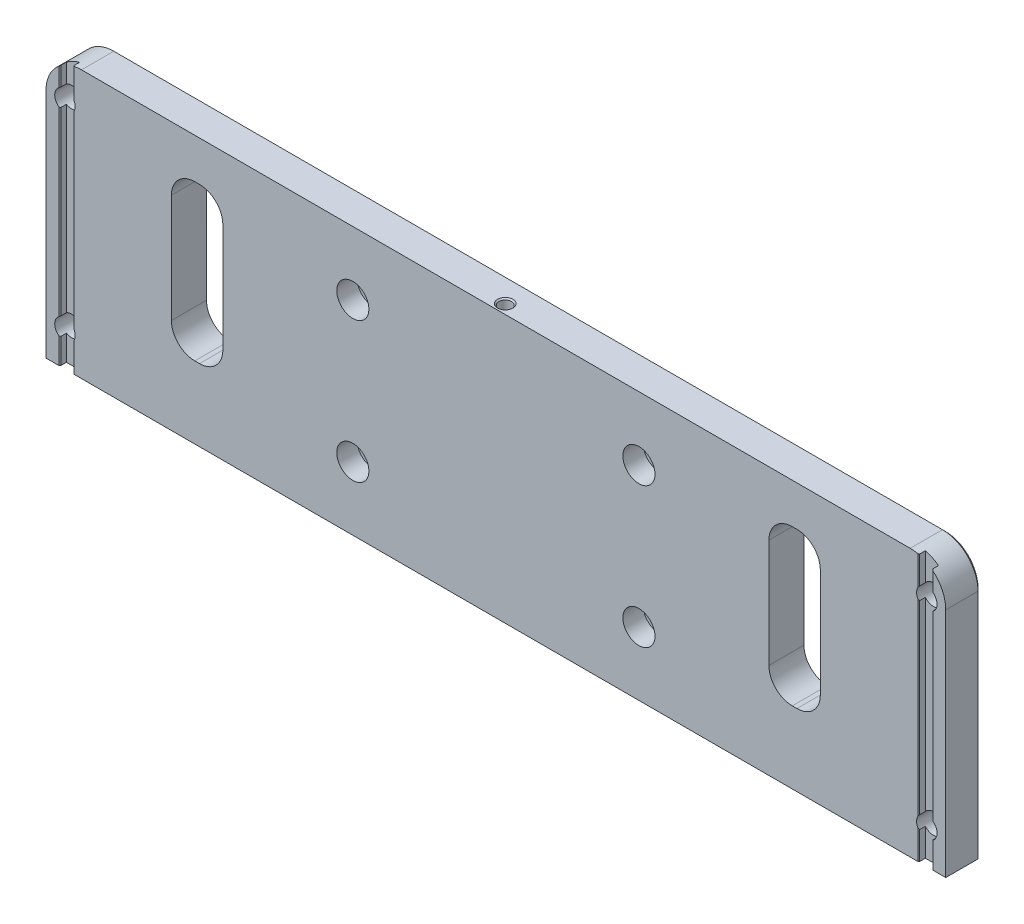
ISO-10303-21;
HEADER;
FILE_DESCRIPTION(('STEP AP214'),'2;1');
FILE_NAME('part.step','',(''),(''),'','','');
FILE_SCHEMA(('AUTOMOTIVE_DESIGN { 1 0 10303 214 1 1 1 1 }'));
ENDSEC;
DATA;
#1=APPLICATION_CONTEXT('core data for automotive mechanical design processes');
#2=APPLICATION_PROTOCOL_DEFINITION('international standard','automotive_design',2000,#1);
#3=PRODUCT_CONTEXT('',#1,'mechanical');
#4=PRODUCT('Part','Part','',(#3));
#5=PRODUCT_RELATED_PRODUCT_CATEGORY('part','',(#4));
#6=PRODUCT_DEFINITION_FORMATION('','',#4);
#7=PRODUCT_DEFINITION_CONTEXT('part definition',#1,'design');
#8=PRODUCT_DEFINITION('design','',#6,#7);
#9=PRODUCT_DEFINITION_SHAPE('','',#8);
#10=(LENGTH_UNIT() NAMED_UNIT(*) SI_UNIT(.MILLI.,.METRE.));
#11=(NAMED_UNIT(*) PLANE_ANGLE_UNIT() SI_UNIT($,.RADIAN.));
#12=(NAMED_UNIT(*) SI_UNIT($,.STERADIAN.) SOLID_ANGLE_UNIT());
#13=UNCERTAINTY_MEASURE_WITH_UNIT(LENGTH_MEASURE(1.E-05),#10,'distance_accuracy_value','');
#14=(GEOMETRIC_REPRESENTATION_CONTEXT(3) GLOBAL_UNCERTAINTY_ASSIGNED_CONTEXT((#13)) GLOBAL_UNIT_ASSIGNED_CONTEXT((#10,
#11,#12)) REPRESENTATION_CONTEXT('',''));
#15=CARTESIAN_POINT('',(0.,0.,0.));
#16=DIRECTION('',(0.,0.,1.));
#17=DIRECTION('',(1.,0.,0.));
#18=AXIS2_PLACEMENT_3D('',#15,#16,#17);
#19=CARTESIAN_POINT('',(118.4529,72.898,-16.256));
#20=DIRECTION('',(0.,-1.,0.));
#21=DIRECTION('',(1.,0.,0.));
#22=AXIS2_PLACEMENT_3D('',#19,#20,#21);
#23=PLANE('',#22);
#24=DIRECTION('',(0.,0.,1.));
#25=VECTOR('',#24,1.);
#26=CARTESIAN_POINT('',(112.5601,72.898,-25.781));
#27=LINE('',#26,#25);
#28=CARTESIAN_POINT('',(112.5601,72.898,-16.256));
#29=VERTEX_POINT('',#28);
#30=CARTESIAN_POINT('',(112.5601,72.898,-25.019));
#31=VERTEX_POINT('',#30);
#32=EDGE_CURVE('E817',#29,#31,#27,.F.);
#33=ORIENTED_EDGE('',*,*,#32,.T.);
#34=DIRECTION('',(-1.,0.,0.));
#35=VECTOR('',#34,1.);
#36=CARTESIAN_POINT('',(-112.5601,72.898,-25.019));
#37=LINE('',#36,#35);
#38=CARTESIAN_POINT('',(-112.5601,72.898,-25.019));
#39=VERTEX_POINT('',#38);
#40=EDGE_CURVE('E872',#31,#39,#37,.T.);
#41=ORIENTED_EDGE('',*,*,#40,.T.);
#42=DIRECTION('',(0.,0.,1.));
#43=VECTOR('',#42,1.);
#44=CARTESIAN_POINT('',(-112.5601,72.898,-16.256));
#45=LINE('',#44,#43);
#46=CARTESIAN_POINT('',(-112.5601,72.898,-16.256));
#47=VERTEX_POINT('',#46);
#48=EDGE_CURVE('E820',#39,#47,#45,.T.);
#49=ORIENTED_EDGE('',*,*,#48,.T.);
#50=DIRECTION('',(-1.,0.,0.));
#51=VECTOR('',#50,1.);
#52=CARTESIAN_POINT('',(113.4618,72.898,-16.256));
#53=LINE('',#52,#51);
#54=EDGE_CURVE('E604',#29,#47,#53,.T.);
#55=ORIENTED_EDGE('',*,*,#54,.F.);
#56=EDGE_LOOP('',(#33,#41,#49,#55));
#57=FACE_BOUND('',#56,.T.);
#58=DIRECTION('',(0.999999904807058,0.,0.000436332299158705));
#59=VECTOR('',#58,1.);
#60=CARTESIAN_POINT('',(2.08279980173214,72.898,-18.7950912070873));
#61=LINE('',#60,#59);
#62=CARTESIAN_POINT('',(2.08305380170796,72.898,-18.7950910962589));
#63=VERTEX_POINT('',#62);
#64=CARTESIAN_POINT('',(2.08279980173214,72.898,-18.7950912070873));
#65=VERTEX_POINT('',#64);
#66=EDGE_CURVE('E480',#63,#65,#61,.F.);
#67=ORIENTED_EDGE('',*,*,#66,.F.);
#68=CARTESIAN_POINT('',(0.,72.898,-18.796));
#69=DIRECTION('',(0.,1.,0.));
#70=DIRECTION('',(0.,0.,1.));
#71=AXIS2_PLACEMENT_3D('',#68,#69,#70);
#72=CIRCLE('',#71,2.083054);
#73=CARTESIAN_POINT('',(2.083054,72.898,-18.796));
#74=VERTEX_POINT('',#73);
#75=EDGE_CURVE('E1012',#74,#63,#72,.T.);
#76=ORIENTED_EDGE('',*,*,#75,.F.);
#77=DIRECTION('',(1.,0.,0.));
#78=VECTOR('',#77,1.);
#79=CARTESIAN_POINT('',(2.0828,72.898,-18.796));
#80=LINE('',#79,#78);
#81=CARTESIAN_POINT('',(2.0828,72.898,-18.796));
#82=VERTEX_POINT('',#81);
#83=EDGE_CURVE('E19',#74,#82,#80,.F.);
#84=ORIENTED_EDGE('',*,*,#83,.T.);
#85=CARTESIAN_POINT('',(0.,72.898,-18.796));
#86=DIRECTION('',(0.,-1.,0.));
#87=DIRECTION('',(1.,0.,0.));
#88=AXIS2_PLACEMENT_3D('',#85,#86,#87);
#89=CIRCLE('',#88,2.0828);
#90=EDGE_CURVE('E25',#82,#65,#89,.T.);
#91=ORIENTED_EDGE('',*,*,#90,.T.);
#92=EDGE_LOOP('',(#67,#76,#84,#91));
#93=FACE_BOUND('',#92,.T.);
#94=ADVANCED_FACE('F15',(#57,#93),#23,.F.);
#95=CARTESIAN_POINT('',(113.4618,72.898,-16.256));
#96=DIRECTION('',(0.,0.,1.));
#97=DIRECTION('',(1.,0.,0.));
#98=AXIS2_PLACEMENT_3D('',#95,#96,#97);
#99=PLANE('',#98);
#100=DIRECTION('',(0.,1.,0.));
#101=VECTOR('',#100,1.);
#102=CARTESIAN_POINT('',(-74.168,19.812,-16.256));
#103=LINE('',#102,#101);
#104=CARTESIAN_POINT('',(-74.168,26.162,-16.256));
#105=VERTEX_POINT('',#104);
#106=CARTESIAN_POINT('',(-74.168,55.626,-16.256));
#107=VERTEX_POINT('',#106);
#108=EDGE_CURVE('E496',#105,#107,#103,.T.);
#109=ORIENTED_EDGE('',*,*,#108,.F.);
#110=CARTESIAN_POINT('',(-80.518,26.162,-16.256));
#111=DIRECTION('',(0.,0.,1.));
#112=DIRECTION('',(1.,0.,0.));
#113=AXIS2_PLACEMENT_3D('',#110,#111,#112);
#114=CIRCLE('',#113,6.35);
#115=CARTESIAN_POINT('',(-80.518,19.812,-16.256));
#116=VERTEX_POINT('',#115);
#117=EDGE_CURVE('E805',#105,#116,#114,.F.);
#118=ORIENTED_EDGE('',*,*,#117,.T.);
#119=DIRECTION('',(1.,0.,0.));
#120=VECTOR('',#119,1.);
#121=CARTESIAN_POINT('',(-88.138,19.812,-16.256));
#122=LINE('',#121,#120);
#123=CARTESIAN_POINT('',(-81.788,19.812,-16.256));
#124=VERTEX_POINT('',#123);
#125=EDGE_CURVE('E505',#124,#116,#122,.T.);
#126=ORIENTED_EDGE('',*,*,#125,.F.);
#127=CARTESIAN_POINT('',(-81.788,26.162,-16.256));
#128=DIRECTION('',(0.,0.,1.));
#129=DIRECTION('',(1.,0.,0.));
#130=AXIS2_PLACEMENT_3D('',#127,#128,#129);
#131=CIRCLE('',#130,6.35);
#132=CARTESIAN_POINT('',(-88.138,26.162,-16.256));
#133=VERTEX_POINT('',#132);
#134=EDGE_CURVE('E801',#124,#133,#131,.F.);
#135=ORIENTED_EDGE('',*,*,#134,.T.);
#136=DIRECTION('',(0.,-1.,0.));
#137=VECTOR('',#136,1.);
#138=CARTESIAN_POINT('',(-88.138,61.976,-16.256));
#139=LINE('',#138,#137);
#140=CARTESIAN_POINT('',(-88.138,55.626,-16.256));
#141=VERTEX_POINT('',#140);
#142=EDGE_CURVE('E502',#141,#133,#139,.T.);
#143=ORIENTED_EDGE('',*,*,#142,.F.);
#144=CARTESIAN_POINT('',(-81.788,55.626,-16.256));
#145=DIRECTION('',(0.,0.,1.));
#146=DIRECTION('',(1.,0.,0.));
#147=AXIS2_PLACEMENT_3D('',#144,#145,#146);
#148=CIRCLE('',#147,6.35);
#149=CARTESIAN_POINT('',(-81.788,61.976,-16.256));
#150=VERTEX_POINT('',#149);
#151=EDGE_CURVE('E813',#141,#150,#148,.F.);
#152=ORIENTED_EDGE('',*,*,#151,.T.);
#153=DIRECTION('',(-1.,0.,0.));
#154=VECTOR('',#153,1.);
#155=CARTESIAN_POINT('',(-74.168,61.976,-16.256));
#156=LINE('',#155,#154);
#157=CARTESIAN_POINT('',(-80.518,61.976,-16.256));
#158=VERTEX_POINT('',#157);
#159=EDGE_CURVE('E499',#158,#150,#156,.T.);
#160=ORIENTED_EDGE('',*,*,#159,.F.);
#161=CARTESIAN_POINT('',(-80.518,55.626,-16.256));
#162=DIRECTION('',(0.,0.,1.));
#163=DIRECTION('',(1.,0.,0.));
#164=AXIS2_PLACEMENT_3D('',#161,#162,#163);
#165=CIRCLE('',#164,6.35);
#166=EDGE_CURVE('E809',#158,#107,#165,.F.);
#167=ORIENTED_EDGE('',*,*,#166,.T.);
#168=EDGE_LOOP('',(#109,#118,#126,#135,#143,#152,#160,#167));
#169=FACE_BOUND('',#168,.T.);
#170=CARTESIAN_POINT('',(-112.5601,63.246,-16.256));
#171=DIRECTION('',(0.,0.,1.));
#172=DIRECTION('',(1.,0.,0.));
#173=AXIS2_PLACEMENT_3D('',#170,#171,#172);
#174=CIRCLE('',#173,9.652);
#175=CARTESIAN_POINT('',(-114.6429,72.6705980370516,-16.256));
#176=VERTEX_POINT('',#175);
#177=EDGE_CURVE('E824',#47,#176,#174,.T.);
#178=ORIENTED_EDGE('',*,*,#177,.T.);
#179=DIRECTION('',(0.,-1.,0.));
#180=VECTOR('',#179,1.);
#181=CARTESIAN_POINT('',(-114.6429,72.898,-16.256));
#182=LINE('',#181,#180);
#183=CARTESIAN_POINT('',(-114.6429,64.727237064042,-16.256));
#184=VERTEX_POINT('',#183);
#185=EDGE_CURVE('E888',#176,#184,#182,.T.);
#186=ORIENTED_EDGE('',*,*,#185,.T.);
#187=CARTESIAN_POINT('',(-117.0686,63.373,-16.256));
#188=DIRECTION('',(0.,0.,1.));
#189=DIRECTION('',(1.,0.,0.));
#190=AXIS2_PLACEMENT_3D('',#187,#188,#189);
#191=CIRCLE('',#190,2.778125);
#192=CARTESIAN_POINT('',(-114.6429,62.018762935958,-16.256));
#193=VERTEX_POINT('',#192);
#194=EDGE_CURVE('E612',#193,#184,#191,.T.);
#195=ORIENTED_EDGE('',*,*,#194,.F.);
#196=DIRECTION('',(0.,-1.,0.));
#197=VECTOR('',#196,1.);
#198=CARTESIAN_POINT('',(-114.6429,72.898,-16.256));
#199=LINE('',#198,#197);
#200=CARTESIAN_POINT('',(-114.6429,10.879237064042,-16.256));
#201=VERTEX_POINT('',#200);
#202=EDGE_CURVE('E885',#193,#201,#199,.T.);
#203=ORIENTED_EDGE('',*,*,#202,.T.);
#204=CARTESIAN_POINT('',(-117.0686,9.525,-16.256));
#205=DIRECTION('',(0.,0.,1.));
#206=DIRECTION('',(1.,0.,0.));
#207=AXIS2_PLACEMENT_3D('',#204,#205,#206);
#208=CIRCLE('',#207,2.778125);
#209=CARTESIAN_POINT('',(-114.6429,8.170762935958,-16.256));
#210=VERTEX_POINT('',#209);
#211=EDGE_CURVE('E667',#210,#201,#208,.T.);
#212=ORIENTED_EDGE('',*,*,#211,.F.);
#213=DIRECTION('',(0.,-1.,0.));
#214=VECTOR('',#213,1.);
#215=CARTESIAN_POINT('',(-114.6429,72.898,-16.256));
#216=LINE('',#215,#214);
#217=CARTESIAN_POINT('',(-114.6429,0.254000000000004,-16.256));
#218=VERTEX_POINT('',#217);
#219=EDGE_CURVE('E882',#210,#218,#216,.T.);
#220=ORIENTED_EDGE('',*,*,#219,.T.);
#221=DIRECTION('',(-1.,0.,0.));
#222=VECTOR('',#221,1.);
#223=CARTESIAN_POINT('',(113.4618,0.254000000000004,-16.256));
#224=LINE('',#223,#222);
#225=CARTESIAN_POINT('',(114.6429,0.254000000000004,-16.256));
#226=VERTEX_POINT('',#225);
#227=EDGE_CURVE('E573',#226,#218,#224,.T.);
#228=ORIENTED_EDGE('',*,*,#227,.F.);
#229=DIRECTION('',(0.,1.,0.));
#230=VECTOR('',#229,1.);
#231=CARTESIAN_POINT('',(114.6429,7.79245919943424,-16.256));
#232=LINE('',#231,#230);
#233=CARTESIAN_POINT('',(114.6429,8.17076293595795,-16.256));
#234=VERTEX_POINT('',#233);
#235=EDGE_CURVE('E880',#226,#234,#232,.T.);
#236=ORIENTED_EDGE('',*,*,#235,.T.);
#237=CARTESIAN_POINT('',(117.0686,9.525,-16.256));
#238=DIRECTION('',(0.,0.,1.));
#239=DIRECTION('',(1.,0.,0.));
#240=AXIS2_PLACEMENT_3D('',#237,#238,#239);
#241=CIRCLE('',#240,2.778125);
#242=CARTESIAN_POINT('',(114.6429,10.879237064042,-16.256));
#243=VERTEX_POINT('',#242);
#244=EDGE_CURVE('E664',#243,#234,#241,.T.);
#245=ORIENTED_EDGE('',*,*,#244,.F.);
#246=DIRECTION('',(0.,1.,0.));
#247=VECTOR('',#246,1.);
#248=CARTESIAN_POINT('',(114.6429,61.6404591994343,-16.256));
#249=LINE('',#248,#247);
#250=CARTESIAN_POINT('',(114.6429,62.018762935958,-16.256));
#251=VERTEX_POINT('',#250);
#252=EDGE_CURVE('E878',#243,#251,#249,.T.);
#253=ORIENTED_EDGE('',*,*,#252,.T.);
#254=CARTESIAN_POINT('',(117.0686,63.373,-16.256));
#255=DIRECTION('',(0.,0.,1.));
#256=DIRECTION('',(1.,0.,0.));
#257=AXIS2_PLACEMENT_3D('',#254,#255,#256);
#258=CIRCLE('',#257,2.778125);
#259=CARTESIAN_POINT('',(114.6429,64.727237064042,-16.256));
#260=VERTEX_POINT('',#259);
#261=EDGE_CURVE('E636',#260,#251,#258,.T.);
#262=ORIENTED_EDGE('',*,*,#261,.F.);
#263=DIRECTION('',(0.,1.,0.));
#264=VECTOR('',#263,1.);
#265=CARTESIAN_POINT('',(114.6429,72.6108528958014,-16.256));
#266=LINE('',#265,#264);
#267=CARTESIAN_POINT('',(114.6429,72.6705980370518,-16.256));
#268=VERTEX_POINT('',#267);
#269=EDGE_CURVE('E876',#260,#268,#266,.T.);
#270=ORIENTED_EDGE('',*,*,#269,.T.);
#271=CARTESIAN_POINT('',(112.5601,63.246,-16.256));
#272=DIRECTION('',(0.,0.,1.));
#273=DIRECTION('',(1.,0.,0.));
#274=AXIS2_PLACEMENT_3D('',#271,#272,#273);
#275=CIRCLE('',#274,9.652);
#276=EDGE_CURVE('E822',#268,#29,#275,.T.);
#277=ORIENTED_EDGE('',*,*,#276,.T.);
#278=ORIENTED_EDGE('',*,*,#54,.T.);
#279=EDGE_LOOP('',(#178,#186,#195,#203,#212,#220,#228,#236,#245,#253,#262,#270,#277,#278));
#280=FACE_BOUND('',#279,.T.);
#281=CARTESIAN_POINT('',(-38.862,55.626,-16.256));
#282=DIRECTION('',(0.,0.,-1.));
#283=DIRECTION('',(-1.,0.,0.));
#284=AXIS2_PLACEMENT_3D('',#281,#282,#283);
#285=CIRCLE('',#284,4.365625);
#286=CARTESIAN_POINT('',(-43.227625,55.626,-16.256));
#287=VERTEX_POINT('',#286);
#288=EDGE_CURVE('E550',#287,#287,#285,.T.);
#289=ORIENTED_EDGE('',*,*,#288,.T.);
#290=EDGE_LOOP('',(#289));
#291=FACE_BOUND('',#290,.T.);
#292=CARTESIAN_POINT('',(-38.862,17.526,-16.256));
#293=DIRECTION('',(0.,0.,-1.));
#294=DIRECTION('',(-1.,0.,0.));
#295=AXIS2_PLACEMENT_3D('',#292,#293,#294);
#296=CIRCLE('',#295,4.365625);
#297=CARTESIAN_POINT('',(-43.227625,17.526,-16.256));
#298=VERTEX_POINT('',#297);
#299=EDGE_CURVE('E540',#298,#298,#296,.T.);
#300=ORIENTED_EDGE('',*,*,#299,.T.);
#301=EDGE_LOOP('',(#300));
#302=FACE_BOUND('',#301,.T.);
#303=CARTESIAN_POINT('',(38.862,55.626,-16.256));
#304=DIRECTION('',(0.,0.,-1.));
#305=DIRECTION('',(-1.,0.,0.));
#306=AXIS2_PLACEMENT_3D('',#303,#304,#305);
#307=CIRCLE('',#306,4.365625);
#308=CARTESIAN_POINT('',(34.496375,55.626,-16.256));
#309=VERTEX_POINT('',#308);
#310=EDGE_CURVE('E530',#309,#309,#307,.T.);
#311=ORIENTED_EDGE('',*,*,#310,.T.);
#312=EDGE_LOOP('',(#311));
#313=FACE_BOUND('',#312,.T.);
#314=CARTESIAN_POINT('',(38.862,17.526,-16.256));
#315=DIRECTION('',(0.,0.,-1.));
#316=DIRECTION('',(-1.,0.,0.));
#317=AXIS2_PLACEMENT_3D('',#314,#315,#316);
#318=CIRCLE('',#317,4.365625);
#319=CARTESIAN_POINT('',(34.496375,17.526,-16.256));
#320=VERTEX_POINT('',#319);
#321=EDGE_CURVE('E520',#320,#320,#318,.T.);
#322=ORIENTED_EDGE('',*,*,#321,.T.);
#323=EDGE_LOOP('',(#322));
#324=FACE_BOUND('',#323,.T.);
#325=DIRECTION('',(0.,-1.,0.));
#326=VECTOR('',#325,1.);
#327=CARTESIAN_POINT('',(88.138,61.976,-16.256));
#328=LINE('',#327,#326);
#329=CARTESIAN_POINT('',(88.138,55.626,-16.256));
#330=VERTEX_POINT('',#329);
#331=CARTESIAN_POINT('',(88.138,26.162,-16.256));
#332=VERTEX_POINT('',#331);
#333=EDGE_CURVE('E514',#330,#332,#328,.T.);
#334=ORIENTED_EDGE('',*,*,#333,.T.);
#335=CARTESIAN_POINT('',(81.788,26.162,-16.256));
#336=DIRECTION('',(0.,0.,1.));
#337=DIRECTION('',(1.,0.,0.));
#338=AXIS2_PLACEMENT_3D('',#335,#336,#337);
#339=CIRCLE('',#338,6.35);
#340=CARTESIAN_POINT('',(81.788,19.812,-16.256));
#341=VERTEX_POINT('',#340);
#342=EDGE_CURVE('E789',#332,#341,#339,.F.);
#343=ORIENTED_EDGE('',*,*,#342,.T.);
#344=DIRECTION('',(-1.,0.,0.));
#345=VECTOR('',#344,1.);
#346=CARTESIAN_POINT('',(88.138,19.812,-16.256));
#347=LINE('',#346,#345);
#348=CARTESIAN_POINT('',(80.518,19.812,-16.256));
#349=VERTEX_POINT('',#348);
#350=EDGE_CURVE('E517',#341,#349,#347,.T.);
#351=ORIENTED_EDGE('',*,*,#350,.T.);
#352=CARTESIAN_POINT('',(80.518,26.162,-16.256));
#353=DIRECTION('',(0.,0.,1.));
#354=DIRECTION('',(1.,0.,0.));
#355=AXIS2_PLACEMENT_3D('',#352,#353,#354);
#356=CIRCLE('',#355,6.35);
#357=CARTESIAN_POINT('',(74.168,26.162,-16.256));
#358=VERTEX_POINT('',#357);
#359=EDGE_CURVE('E785',#349,#358,#356,.F.);
#360=ORIENTED_EDGE('',*,*,#359,.T.);
#361=DIRECTION('',(0.,1.,0.));
#362=VECTOR('',#361,1.);
#363=CARTESIAN_POINT('',(74.168,19.812,-16.256));
#364=LINE('',#363,#362);
#365=CARTESIAN_POINT('',(74.168,55.626,-16.256));
#366=VERTEX_POINT('',#365);
#367=EDGE_CURVE('E508',#358,#366,#364,.T.);
#368=ORIENTED_EDGE('',*,*,#367,.T.);
#369=CARTESIAN_POINT('',(80.518,55.626,-16.256));
#370=DIRECTION('',(0.,0.,1.));
#371=DIRECTION('',(1.,0.,0.));
#372=AXIS2_PLACEMENT_3D('',#369,#370,#371);
#373=CIRCLE('',#372,6.35);
#374=CARTESIAN_POINT('',(80.518,61.976,-16.256));
#375=VERTEX_POINT('',#374);
#376=EDGE_CURVE('E797',#366,#375,#373,.F.);
#377=ORIENTED_EDGE('',*,*,#376,.T.);
#378=DIRECTION('',(1.,0.,0.));
#379=VECTOR('',#378,1.);
#380=CARTESIAN_POINT('',(74.168,61.976,-16.256));
#381=LINE('',#380,#379);
#382=CARTESIAN_POINT('',(81.788,61.976,-16.256));
#383=VERTEX_POINT('',#382);
#384=EDGE_CURVE('E511',#375,#383,#381,.T.);
#385=ORIENTED_EDGE('',*,*,#384,.T.);
#386=CARTESIAN_POINT('',(81.788,55.626,-16.256));
#387=DIRECTION('',(0.,0.,1.));
#388=DIRECTION('',(1.,0.,0.));
#389=AXIS2_PLACEMENT_3D('',#386,#387,#388);
#390=CIRCLE('',#389,6.35);
#391=EDGE_CURVE('E793',#383,#330,#390,.F.);
#392=ORIENTED_EDGE('',*,*,#391,.T.);
#393=EDGE_LOOP('',(#334,#343,#351,#360,#368,#377,#385,#392));
#394=FACE_BOUND('',#393,.T.);
#395=ADVANCED_FACE('F1048',(#169,#280,#291,#302,#313,#324,#394),#99,.T.);
#396=CARTESIAN_POINT('',(-122.2121,72.898,-25.781));
#397=DIRECTION('',(0.,0.,-1.));
#398=DIRECTION('',(-1.,0.,0.));
#399=AXIS2_PLACEMENT_3D('',#396,#397,#398);
#400=PLANE('',#399);
#401=CARTESIAN_POINT('',(112.5601,63.246,-25.781));
#402=DIRECTION('',(0.,0.,-1.));
#403=DIRECTION('',(-1.,0.,0.));
#404=AXIS2_PLACEMENT_3D('',#401,#402,#403);
#405=CIRCLE('',#404,8.89);
#406=CARTESIAN_POINT('',(112.5601,72.136,-25.781));
#407=VERTEX_POINT('',#406);
#408=CARTESIAN_POINT('',(121.4501,63.246,-25.781));
#409=VERTEX_POINT('',#408);
#410=EDGE_CURVE('E858',#407,#409,#405,.T.);
#411=ORIENTED_EDGE('',*,*,#410,.T.);
#412=DIRECTION('',(0.,-1.,0.));
#413=VECTOR('',#412,1.);
#414=CARTESIAN_POINT('',(121.4501,72.898,-25.781));
#415=LINE('',#414,#413);
#416=CARTESIAN_POINT('',(121.4501,1.016,-25.781));
#417=VERTEX_POINT('',#416);
#418=EDGE_CURVE('E860',#409,#417,#415,.T.);
#419=ORIENTED_EDGE('',*,*,#418,.T.);
#420=DIRECTION('',(-1.,0.,0.));
#421=VECTOR('',#420,1.);
#422=CARTESIAN_POINT('',(-122.2121,1.016,-25.781));
#423=LINE('',#422,#421);
#424=CARTESIAN_POINT('',(-121.4501,1.016,-25.781));
#425=VERTEX_POINT('',#424);
#426=EDGE_CURVE('E856',#417,#425,#423,.T.);
#427=ORIENTED_EDGE('',*,*,#426,.T.);
#428=DIRECTION('',(0.,1.,0.));
#429=VECTOR('',#428,1.);
#430=CARTESIAN_POINT('',(-121.4501,63.246,-25.781));
#431=LINE('',#430,#429);
#432=CARTESIAN_POINT('',(-121.4501,63.246,-25.781));
#433=VERTEX_POINT('',#432);
#434=EDGE_CURVE('E854',#425,#433,#431,.T.);
#435=ORIENTED_EDGE('',*,*,#434,.T.);
#436=CARTESIAN_POINT('',(-112.5601,63.246,-25.781));
#437=DIRECTION('',(0.,0.,-1.));
#438=DIRECTION('',(-1.,0.,0.));
#439=AXIS2_PLACEMENT_3D('',#436,#437,#438);
#440=CIRCLE('',#439,8.89);
#441=CARTESIAN_POINT('',(-112.5601,72.136,-25.781));
#442=VERTEX_POINT('',#441);
#443=EDGE_CURVE('E850',#433,#442,#440,.T.);
#444=ORIENTED_EDGE('',*,*,#443,.T.);
#445=DIRECTION('',(1.,0.,0.));
#446=VECTOR('',#445,1.);
#447=CARTESIAN_POINT('',(112.5601,72.136,-25.781));
#448=LINE('',#447,#446);
#449=EDGE_CURVE('E852',#442,#407,#448,.T.);
#450=ORIENTED_EDGE('',*,*,#449,.T.);
#451=EDGE_LOOP('',(#411,#419,#427,#435,#444,#450));
#452=FACE_BOUND('',#451,.T.);
#453=DIRECTION('',(0.,-1.,0.));
#454=VECTOR('',#453,1.);
#455=CARTESIAN_POINT('',(-74.168,72.898,-25.781));
#456=LINE('',#455,#454);
#457=CARTESIAN_POINT('',(-74.168,55.626,-25.781));
#458=VERTEX_POINT('',#457);
#459=CARTESIAN_POINT('',(-74.168,26.162,-25.781));
#460=VERTEX_POINT('',#459);
#461=EDGE_CURVE('E742',#458,#460,#456,.T.);
#462=ORIENTED_EDGE('',*,*,#461,.F.);
#463=CARTESIAN_POINT('',(-80.518,55.626,-25.781));
#464=DIRECTION('',(0.,0.,-1.));
#465=DIRECTION('',(-1.,0.,0.));
#466=AXIS2_PLACEMENT_3D('',#463,#464,#465);
#467=CIRCLE('',#466,6.35);
#468=CARTESIAN_POINT('',(-80.518,61.976,-25.781));
#469=VERTEX_POINT('',#468);
#470=EDGE_CURVE('E811',#458,#469,#467,.F.);
#471=ORIENTED_EDGE('',*,*,#470,.T.);
#472=DIRECTION('',(1.,0.,0.));
#473=VECTOR('',#472,1.);
#474=CARTESIAN_POINT('',(-122.2121,61.976,-25.781));
#475=LINE('',#474,#473);
#476=CARTESIAN_POINT('',(-81.788,61.976,-25.781));
#477=VERTEX_POINT('',#476);
#478=EDGE_CURVE('E739',#477,#469,#475,.T.);
#479=ORIENTED_EDGE('',*,*,#478,.F.);
#480=CARTESIAN_POINT('',(-81.788,55.626,-25.781));
#481=DIRECTION('',(0.,0.,-1.));
#482=DIRECTION('',(-1.,0.,0.));
#483=AXIS2_PLACEMENT_3D('',#480,#481,#482);
#484=CIRCLE('',#483,6.35);
#485=CARTESIAN_POINT('',(-88.138,55.626,-25.781));
#486=VERTEX_POINT('',#485);
#487=EDGE_CURVE('E815',#477,#486,#484,.F.);
#488=ORIENTED_EDGE('',*,*,#487,.T.);
#489=DIRECTION('',(0.,1.,0.));
#490=VECTOR('',#489,1.);
#491=CARTESIAN_POINT('',(-88.138,72.898,-25.781));
#492=LINE('',#491,#490);
#493=CARTESIAN_POINT('',(-88.138,26.162,-25.781));
#494=VERTEX_POINT('',#493);
#495=EDGE_CURVE('E736',#494,#486,#492,.T.);
#496=ORIENTED_EDGE('',*,*,#495,.F.);
#497=CARTESIAN_POINT('',(-81.788,26.162,-25.781));
#498=DIRECTION('',(0.,0.,-1.));
#499=DIRECTION('',(-1.,0.,0.));
#500=AXIS2_PLACEMENT_3D('',#497,#498,#499);
#501=CIRCLE('',#500,6.35);
#502=CARTESIAN_POINT('',(-81.788,19.812,-25.781));
#503=VERTEX_POINT('',#502);
#504=EDGE_CURVE('E803',#494,#503,#501,.F.);
#505=ORIENTED_EDGE('',*,*,#504,.T.);
#506=DIRECTION('',(-1.,0.,0.));
#507=VECTOR('',#506,1.);
#508=CARTESIAN_POINT('',(-122.2121,19.812,-25.781));
#509=LINE('',#508,#507);
#510=CARTESIAN_POINT('',(-80.518,19.812,-25.781));
#511=VERTEX_POINT('',#510);
#512=EDGE_CURVE('E733',#511,#503,#509,.T.);
#513=ORIENTED_EDGE('',*,*,#512,.F.);
#514=CARTESIAN_POINT('',(-80.518,26.162,-25.781));
#515=DIRECTION('',(0.,0.,-1.));
#516=DIRECTION('',(-1.,0.,0.));
#517=AXIS2_PLACEMENT_3D('',#514,#515,#516);
#518=CIRCLE('',#517,6.35);
#519=EDGE_CURVE('E807',#511,#460,#518,.F.);
#520=ORIENTED_EDGE('',*,*,#519,.T.);
#521=EDGE_LOOP('',(#462,#471,#479,#488,#496,#505,#513,#520));
#522=FACE_BOUND('',#521,.T.);
#523=DIRECTION('',(0.,1.,0.));
#524=VECTOR('',#523,1.);
#525=CARTESIAN_POINT('',(74.168,72.898,-25.781));
#526=LINE('',#525,#524);
#527=CARTESIAN_POINT('',(74.168,26.162,-25.781));
#528=VERTEX_POINT('',#527);
#529=CARTESIAN_POINT('',(74.168,55.626,-25.781));
#530=VERTEX_POINT('',#529);
#531=EDGE_CURVE('E730',#528,#530,#526,.T.);
#532=ORIENTED_EDGE('',*,*,#531,.F.);
#533=CARTESIAN_POINT('',(80.518,26.162,-25.781));
#534=DIRECTION('',(0.,0.,-1.));
#535=DIRECTION('',(-1.,0.,0.));
#536=AXIS2_PLACEMENT_3D('',#533,#534,#535);
#537=CIRCLE('',#536,6.35);
#538=CARTESIAN_POINT('',(80.518,19.812,-25.781));
#539=VERTEX_POINT('',#538);
#540=EDGE_CURVE('E787',#528,#539,#537,.F.);
#541=ORIENTED_EDGE('',*,*,#540,.T.);
#542=DIRECTION('',(-1.,0.,0.));
#543=VECTOR('',#542,1.);
#544=CARTESIAN_POINT('',(-122.2121,19.812,-25.781));
#545=LINE('',#544,#543);
#546=CARTESIAN_POINT('',(81.788,19.812,-25.781));
#547=VERTEX_POINT('',#546);
#548=EDGE_CURVE('E618',#547,#539,#545,.T.);
#549=ORIENTED_EDGE('',*,*,#548,.F.);
#550=CARTESIAN_POINT('',(81.788,26.162,-25.781));
#551=DIRECTION('',(0.,0.,-1.));
#552=DIRECTION('',(-1.,0.,0.));
#553=AXIS2_PLACEMENT_3D('',#550,#551,#552);
#554=CIRCLE('',#553,6.35);
#555=CARTESIAN_POINT('',(88.138,26.162,-25.781));
#556=VERTEX_POINT('',#555);
#557=EDGE_CURVE('E791',#547,#556,#554,.F.);
#558=ORIENTED_EDGE('',*,*,#557,.T.);
#559=DIRECTION('',(0.,-1.,0.));
#560=VECTOR('',#559,1.);
#561=CARTESIAN_POINT('',(88.138,72.898,-25.781));
#562=LINE('',#561,#560);
#563=CARTESIAN_POINT('',(88.138,55.626,-25.781));
#564=VERTEX_POINT('',#563);
#565=EDGE_CURVE('E724',#564,#556,#562,.T.);
#566=ORIENTED_EDGE('',*,*,#565,.F.);
#567=CARTESIAN_POINT('',(81.788,55.626,-25.781));
#568=DIRECTION('',(0.,0.,-1.));
#569=DIRECTION('',(-1.,0.,0.));
#570=AXIS2_PLACEMENT_3D('',#567,#568,#569);
#571=CIRCLE('',#570,6.35);
#572=CARTESIAN_POINT('',(81.788,61.976,-25.781));
#573=VERTEX_POINT('',#572);
#574=EDGE_CURVE('E795',#564,#573,#571,.F.);
#575=ORIENTED_EDGE('',*,*,#574,.T.);
#576=DIRECTION('',(1.,0.,0.));
#577=VECTOR('',#576,1.);
#578=CARTESIAN_POINT('',(-122.2121,61.976,-25.781));
#579=LINE('',#578,#577);
#580=CARTESIAN_POINT('',(80.518,61.976,-25.781));
#581=VERTEX_POINT('',#580);
#582=EDGE_CURVE('E727',#581,#573,#579,.T.);
#583=ORIENTED_EDGE('',*,*,#582,.F.);
#584=CARTESIAN_POINT('',(80.518,55.626,-25.781));
#585=DIRECTION('',(0.,0.,-1.));
#586=DIRECTION('',(-1.,0.,0.));
#587=AXIS2_PLACEMENT_3D('',#584,#585,#586);
#588=CIRCLE('',#587,6.35);
#589=EDGE_CURVE('E799',#581,#530,#588,.F.);
#590=ORIENTED_EDGE('',*,*,#589,.T.);
#591=EDGE_LOOP('',(#532,#541,#549,#558,#566,#575,#583,#590));
#592=FACE_BOUND('',#591,.T.);
#593=CARTESIAN_POINT('',(38.862,17.526,-25.781));
#594=DIRECTION('',(0.,0.,-1.));
#595=DIRECTION('',(-1.,0.,0.));
#596=AXIS2_PLACEMENT_3D('',#593,#594,#595);
#597=CIRCLE('',#596,2.778125);
#598=CARTESIAN_POINT('',(36.083875,17.526,-25.781));
#599=VERTEX_POINT('',#598);
#600=EDGE_CURVE('E529',#599,#599,#597,.T.);
#601=ORIENTED_EDGE('',*,*,#600,.F.);
#602=EDGE_LOOP('',(#601));
#603=FACE_BOUND('',#602,.T.);
#604=CARTESIAN_POINT('',(38.862,55.626,-25.781));
#605=DIRECTION('',(0.,0.,-1.));
#606=DIRECTION('',(-1.,0.,0.));
#607=AXIS2_PLACEMENT_3D('',#604,#605,#606);
#608=CIRCLE('',#607,2.778125);
#609=CARTESIAN_POINT('',(36.083875,55.626,-25.781));
#610=VERTEX_POINT('',#609);
#611=EDGE_CURVE('E539',#610,#610,#608,.T.);
#612=ORIENTED_EDGE('',*,*,#611,.F.);
#613=EDGE_LOOP('',(#612));
#614=FACE_BOUND('',#613,.T.);
#615=CARTESIAN_POINT('',(-38.862,17.526,-25.781));
#616=DIRECTION('',(0.,0.,-1.));
#617=DIRECTION('',(-1.,0.,0.));
#618=AXIS2_PLACEMENT_3D('',#615,#616,#617);
#619=CIRCLE('',#618,2.778125);
#620=CARTESIAN_POINT('',(-41.640125,17.526,-25.781));
#621=VERTEX_POINT('',#620);
#622=EDGE_CURVE('E549',#621,#621,#619,.T.);
#623=ORIENTED_EDGE('',*,*,#622,.F.);
#624=EDGE_LOOP('',(#623));
#625=FACE_BOUND('',#624,.T.);
#626=CARTESIAN_POINT('',(-38.862,55.626,-25.781));
#627=DIRECTION('',(0.,0.,-1.));
#628=DIRECTION('',(-1.,0.,0.));
#629=AXIS2_PLACEMENT_3D('',#626,#627,#628);
#630=CIRCLE('',#629,2.778125);
#631=CARTESIAN_POINT('',(-41.640125,55.626,-25.781));
#632=VERTEX_POINT('',#631);
#633=EDGE_CURVE('E559',#632,#632,#630,.T.);
#634=ORIENTED_EDGE('',*,*,#633,.F.);
#635=EDGE_LOOP('',(#634));
#636=FACE_BOUND('',#635,.T.);
#637=CARTESIAN_POINT('',(-117.0686,63.373,-25.781));
#638=DIRECTION('',(0.,0.,-1.));
#639=DIRECTION('',(-1.,0.,0.));
#640=AXIS2_PLACEMENT_3D('',#637,#638,#639);
#641=CIRCLE('',#640,2.778125);
#642=CARTESIAN_POINT('',(-119.846725,63.373,-25.781));
#643=VERTEX_POINT('',#642);
#644=EDGE_CURVE('E585',#643,#643,#641,.T.);
#645=ORIENTED_EDGE('',*,*,#644,.F.);
#646=EDGE_LOOP('',(#645));
#647=FACE_BOUND('',#646,.T.);
#648=CARTESIAN_POINT('',(117.0686,63.373,-25.781));
#649=DIRECTION('',(0.,0.,-1.));
#650=DIRECTION('',(-1.,0.,0.));
#651=AXIS2_PLACEMENT_3D('',#648,#649,#650);
#652=CIRCLE('',#651,2.778125);
#653=CARTESIAN_POINT('',(114.290475,63.373,-25.781));
#654=VERTEX_POINT('',#653);
#655=EDGE_CURVE('E622',#654,#654,#652,.T.);
#656=ORIENTED_EDGE('',*,*,#655,.F.);
#657=EDGE_LOOP('',(#656));
#658=FACE_BOUND('',#657,.T.);
#659=CARTESIAN_POINT('',(117.0686,9.525,-25.781));
#660=DIRECTION('',(0.,0.,-1.));
#661=DIRECTION('',(-1.,0.,0.));
#662=AXIS2_PLACEMENT_3D('',#659,#660,#661);
#663=CIRCLE('',#662,2.778125);
#664=CARTESIAN_POINT('',(114.290475,9.525,-25.781));
#665=VERTEX_POINT('',#664);
#666=EDGE_CURVE('E643',#665,#665,#663,.T.);
#667=ORIENTED_EDGE('',*,*,#666,.F.);
#668=EDGE_LOOP('',(#667));
#669=FACE_BOUND('',#668,.T.);
#670=CARTESIAN_POINT('',(-117.0686,9.525,-25.781));
#671=DIRECTION('',(0.,0.,-1.));
#672=DIRECTION('',(-1.,0.,0.));
#673=AXIS2_PLACEMENT_3D('',#670,#671,#672);
#674=CIRCLE('',#673,2.778125);
#675=CARTESIAN_POINT('',(-119.846725,9.525,-25.781));
#676=VERTEX_POINT('',#675);
#677=EDGE_CURVE('E655',#676,#676,#674,.T.);
#678=ORIENTED_EDGE('',*,*,#677,.F.);
#679=EDGE_LOOP('',(#678));
#680=FACE_BOUND('',#679,.T.);
#681=ADVANCED_FACE('F1054',(#452,#522,#592,#603,#614,#625,#636,#647,#658,#669,#680),#400,.T.);
#682=CARTESIAN_POINT('',(118.4529,72.898,-16.256));
#683=DIRECTION('',(0.,0.,-1.));
#684=DIRECTION('',(-1.,0.,0.));
#685=AXIS2_PLACEMENT_3D('',#682,#683,#684);
#686=PLANE('',#685);
#687=CARTESIAN_POINT('',(117.0686,9.525,-16.256));
#688=DIRECTION('',(0.,0.,-1.));
#689=DIRECTION('',(-1.,0.,0.));
#690=AXIS2_PLACEMENT_3D('',#687,#688,#689);
#691=CIRCLE('',#690,2.778125);
#692=CARTESIAN_POINT('',(118.7069,11.7686469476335,-16.256));
#693=VERTEX_POINT('',#692);
#694=CARTESIAN_POINT('',(118.7069,7.28135305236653,-16.256));
#695=VERTEX_POINT('',#694);
#696=EDGE_CURVE('E651',#693,#695,#691,.T.);
#697=ORIENTED_EDGE('',*,*,#696,.T.);
#698=DIRECTION('',(0.,-1.,0.));
#699=VECTOR('',#698,1.);
#700=CARTESIAN_POINT('',(118.7069,72.898,-16.256));
#701=LINE('',#700,#699);
#702=CARTESIAN_POINT('',(118.7069,0.254000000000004,-16.256));
#703=VERTEX_POINT('',#702);
#704=EDGE_CURVE('E946',#695,#703,#701,.T.);
#705=ORIENTED_EDGE('',*,*,#704,.T.);
#706=DIRECTION('',(1.,0.,0.));
#707=VECTOR('',#706,1.);
#708=CARTESIAN_POINT('',(118.4529,0.254000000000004,-16.256));
#709=LINE('',#708,#707);
#710=CARTESIAN_POINT('',(122.2121,0.254000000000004,-16.256));
#711=VERTEX_POINT('',#710);
#712=EDGE_CURVE('E576',#703,#711,#709,.T.);
#713=ORIENTED_EDGE('',*,*,#712,.T.);
#714=DIRECTION('',(0.,-1.,0.));
#715=VECTOR('',#714,1.);
#716=CARTESIAN_POINT('',(122.2121,72.898,-16.256));
#717=LINE('',#716,#715);
#718=CARTESIAN_POINT('',(122.2121,63.246,-16.256));
#719=VERTEX_POINT('',#718);
#720=EDGE_CURVE('E560',#719,#711,#717,.T.);
#721=ORIENTED_EDGE('',*,*,#720,.F.);
#722=CARTESIAN_POINT('',(112.5601,63.246,-16.256));
#723=DIRECTION('',(0.,0.,-1.));
#724=DIRECTION('',(-1.,0.,0.));
#725=AXIS2_PLACEMENT_3D('',#722,#723,#724);
#726=CIRCLE('',#725,9.652);
#727=CARTESIAN_POINT('',(118.7069,70.6876364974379,-16.256));
#728=VERTEX_POINT('',#727);
#729=EDGE_CURVE('E841',#719,#728,#726,.F.);
#730=ORIENTED_EDGE('',*,*,#729,.T.);
#731=DIRECTION('',(0.,-1.,0.));
#732=VECTOR('',#731,1.);
#733=CARTESIAN_POINT('',(118.7069,72.898,-16.256));
#734=LINE('',#733,#732);
#735=CARTESIAN_POINT('',(118.7069,65.6166469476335,-16.256));
#736=VERTEX_POINT('',#735);
#737=EDGE_CURVE('E940',#728,#736,#734,.T.);
#738=ORIENTED_EDGE('',*,*,#737,.T.);
#739=CARTESIAN_POINT('',(117.0686,63.373,-16.256));
#740=DIRECTION('',(0.,0.,-1.));
#741=DIRECTION('',(-1.,0.,0.));
#742=AXIS2_PLACEMENT_3D('',#739,#740,#741);
#743=CIRCLE('',#742,2.778125);
#744=CARTESIAN_POINT('',(118.7069,61.1293530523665,-16.256));
#745=VERTEX_POINT('',#744);
#746=EDGE_CURVE('E647',#736,#745,#743,.T.);
#747=ORIENTED_EDGE('',*,*,#746,.T.);
#748=DIRECTION('',(0.,-1.,0.));
#749=VECTOR('',#748,1.);
#750=CARTESIAN_POINT('',(118.7069,72.898,-16.256));
#751=LINE('',#750,#749);
#752=EDGE_CURVE('E943',#745,#693,#751,.T.);
#753=ORIENTED_EDGE('',*,*,#752,.T.);
#754=EDGE_LOOP('',(#697,#705,#713,#721,#730,#738,#747,#753));
#755=FACE_BOUND('',#754,.T.);
#756=ADVANCED_FACE('F1082',(#755),#686,.F.);
#757=CARTESIAN_POINT('',(0.,0.254,0.));
#758=DIRECTION('',(0.,1.,0.));
#759=DIRECTION('',(0.,0.,1.));
#760=AXIS2_PLACEMENT_3D('',#757,#758,#759);
#761=PLANE('',#760);
#762=ORIENTED_EDGE('',*,*,#227,.T.);
#763=DIRECTION('',(0.707106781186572,0.,0.707106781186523));
#764=VECTOR('',#763,1.);
#765=CARTESIAN_POINT('',(-114.6429,0.254000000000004,-16.256));
#766=LINE('',#765,#764);
#767=CARTESIAN_POINT('',(-114.8969,0.254000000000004,-16.51));
#768=VERTEX_POINT('',#767);
#769=EDGE_CURVE('E933',#218,#768,#766,.F.);
#770=ORIENTED_EDGE('',*,*,#769,.T.);
#771=DIRECTION('',(0.,0.,-1.));
#772=VECTOR('',#771,1.);
#773=CARTESIAN_POINT('',(-114.8969,0.254000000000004,-16.256));
#774=LINE('',#773,#772);
#775=CARTESIAN_POINT('',(-114.8969,0.254000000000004,-18.034));
#776=VERTEX_POINT('',#775);
#777=EDGE_CURVE('E571',#768,#776,#774,.T.);
#778=ORIENTED_EDGE('',*,*,#777,.T.);
#779=DIRECTION('',(-1.,0.,0.));
#780=VECTOR('',#779,1.);
#781=CARTESIAN_POINT('',(-114.8969,0.254000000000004,-18.034));
#782=LINE('',#781,#780);
#783=CARTESIAN_POINT('',(-118.4529,0.254000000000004,-18.034));
#784=VERTEX_POINT('',#783);
#785=EDGE_CURVE('E608',#776,#784,#782,.T.);
#786=ORIENTED_EDGE('',*,*,#785,.T.);
#787=DIRECTION('',(0.,0.,1.));
#788=VECTOR('',#787,1.);
#789=CARTESIAN_POINT('',(-118.4529,0.254000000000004,-17.78));
#790=LINE('',#789,#788);
#791=CARTESIAN_POINT('',(-118.4529,0.254000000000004,-16.51));
#792=VERTEX_POINT('',#791);
#793=EDGE_CURVE('E566',#784,#792,#790,.T.);
#794=ORIENTED_EDGE('',*,*,#793,.T.);
#795=DIRECTION('',(0.707106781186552,0.,-0.707106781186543));
#796=VECTOR('',#795,1.);
#797=CARTESIAN_POINT('',(-118.4529,0.254000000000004,-16.51));
#798=LINE('',#797,#796);
#799=CARTESIAN_POINT('',(-118.7069,0.254000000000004,-16.256));
#800=VERTEX_POINT('',#799);
#801=EDGE_CURVE('E931',#792,#800,#798,.F.);
#802=ORIENTED_EDGE('',*,*,#801,.T.);
#803=DIRECTION('',(-1.,0.,0.));
#804=VECTOR('',#803,1.);
#805=CARTESIAN_POINT('',(-118.4529,0.254000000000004,-16.256));
#806=LINE('',#805,#804);
#807=CARTESIAN_POINT('',(-122.2121,0.254,-16.256));
#808=VERTEX_POINT('',#807);
#809=EDGE_CURVE('E569',#800,#808,#806,.T.);
#810=ORIENTED_EDGE('',*,*,#809,.T.);
#811=DIRECTION('',(0.,0.,-1.));
#812=VECTOR('',#811,1.);
#813=CARTESIAN_POINT('',(-122.2121,0.254,0.));
#814=LINE('',#813,#812);
#815=CARTESIAN_POINT('',(-122.2121,0.254,-25.019));
#816=VERTEX_POINT('',#815);
#817=EDGE_CURVE('E611',#808,#816,#814,.T.);
#818=ORIENTED_EDGE('',*,*,#817,.T.);
#819=DIRECTION('',(1.,0.,0.));
#820=VECTOR('',#819,1.);
#821=CARTESIAN_POINT('',(122.2121,0.254,-25.019));
#822=LINE('',#821,#820);
#823=CARTESIAN_POINT('',(122.2121,0.254,-25.019));
#824=VERTEX_POINT('',#823);
#825=EDGE_CURVE('E868',#816,#824,#822,.T.);
#826=ORIENTED_EDGE('',*,*,#825,.T.);
#827=DIRECTION('',(0.,0.,-1.));
#828=VECTOR('',#827,1.);
#829=CARTESIAN_POINT('',(122.2121,0.254,0.));
#830=LINE('',#829,#828);
#831=EDGE_CURVE('E615',#711,#824,#830,.T.);
#832=ORIENTED_EDGE('',*,*,#831,.F.);
#833=ORIENTED_EDGE('',*,*,#712,.F.);
#834=DIRECTION('',(0.707106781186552,0.,0.707106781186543));
#835=VECTOR('',#834,1.);
#836=CARTESIAN_POINT('',(118.7069,0.254000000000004,-16.256));
#837=LINE('',#836,#835);
#838=CARTESIAN_POINT('',(118.4529,0.254000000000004,-16.51));
#839=VERTEX_POINT('',#838);
#840=EDGE_CURVE('E929',#703,#839,#837,.F.);
#841=ORIENTED_EDGE('',*,*,#840,.T.);
#842=DIRECTION('',(0.,0.,1.));
#843=VECTOR('',#842,1.);
#844=CARTESIAN_POINT('',(118.4529,0.254000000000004,-17.78));
#845=LINE('',#844,#843);
#846=CARTESIAN_POINT('',(118.4529,0.254000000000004,-18.034));
#847=VERTEX_POINT('',#846);
#848=EDGE_CURVE('E578',#847,#839,#845,.T.);
#849=ORIENTED_EDGE('',*,*,#848,.F.);
#850=DIRECTION('',(1.,0.,0.));
#851=VECTOR('',#850,1.);
#852=CARTESIAN_POINT('',(114.8969,0.254000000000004,-18.034));
#853=LINE('',#852,#851);
#854=CARTESIAN_POINT('',(114.8969,0.254000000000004,-18.034));
#855=VERTEX_POINT('',#854);
#856=EDGE_CURVE('E581',#855,#847,#853,.T.);
#857=ORIENTED_EDGE('',*,*,#856,.F.);
#858=DIRECTION('',(0.,0.,-1.));
#859=VECTOR('',#858,1.);
#860=CARTESIAN_POINT('',(114.8969,0.254000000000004,-16.256));
#861=LINE('',#860,#859);
#862=CARTESIAN_POINT('',(114.8969,0.254000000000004,-16.51));
#863=VERTEX_POINT('',#862);
#864=EDGE_CURVE('E583',#863,#855,#861,.T.);
#865=ORIENTED_EDGE('',*,*,#864,.F.);
#866=DIRECTION('',(-0.707106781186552,0.,0.707106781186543));
#867=VECTOR('',#866,1.);
#868=CARTESIAN_POINT('',(114.8969,0.254000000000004,-16.51));
#869=LINE('',#868,#867);
#870=EDGE_CURVE('E927',#863,#226,#869,.T.);
#871=ORIENTED_EDGE('',*,*,#870,.T.);
#872=EDGE_LOOP('',(#762,#770,#778,#786,#794,#802,#810,#818,#826,#832,#833,#841,#849,#857,#865,#871));
#873=FACE_BOUND('',#872,.T.);
#874=ADVANCED_FACE('F1086',(#873),#761,.F.);
#875=CARTESIAN_POINT('',(-118.4529,72.898,-17.78));
#876=DIRECTION('',(1.,0.,0.));
#877=DIRECTION('',(0.,0.,-1.));
#878=AXIS2_PLACEMENT_3D('',#875,#876,#877);
#879=PLANE('',#878);
#880=DIRECTION('',(0.,0.,1.));
#881=VECTOR('',#880,1.);
#882=CARTESIAN_POINT('',(-118.4529,70.8903451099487,-18.034));
#883=LINE('',#882,#881);
#884=CARTESIAN_POINT('',(-118.4529,70.8903451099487,-18.034));
#885=VERTEX_POINT('',#884);
#886=CARTESIAN_POINT('',(-118.4529,70.8903451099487,-16.51));
#887=VERTEX_POINT('',#886);
#888=EDGE_CURVE('E831',#885,#887,#883,.T.);
#889=ORIENTED_EDGE('',*,*,#888,.T.);
#890=DIRECTION('',(0.,-1.,0.));
#891=VECTOR('',#890,1.);
#892=CARTESIAN_POINT('',(-118.4529,72.898,-16.51));
#893=LINE('',#892,#891);
#894=CARTESIAN_POINT('',(-118.4529,65.7816701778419,-16.51));
#895=VERTEX_POINT('',#894);
#896=EDGE_CURVE('E905',#887,#895,#893,.T.);
#897=ORIENTED_EDGE('',*,*,#896,.T.);
#898=DIRECTION('',(0.,0.,1.));
#899=VECTOR('',#898,1.);
#900=CARTESIAN_POINT('',(-118.4529,65.7816701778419,-17.145));
#901=LINE('',#900,#899);
#902=CARTESIAN_POINT('',(-118.4529,65.7816701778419,-18.034));
#903=VERTEX_POINT('',#902);
#904=EDGE_CURVE('E623',#903,#895,#901,.T.);
#905=ORIENTED_EDGE('',*,*,#904,.F.);
#906=DIRECTION('',(0.,-1.,0.));
#907=VECTOR('',#906,1.);
#908=CARTESIAN_POINT('',(-118.4529,72.898,-18.034));
#909=LINE('',#908,#907);
#910=EDGE_CURVE('E597',#885,#903,#909,.T.);
#911=ORIENTED_EDGE('',*,*,#910,.F.);
#912=EDGE_LOOP('',(#889,#897,#905,#911));
#913=FACE_BOUND('',#912,.T.);
#914=ADVANCED_FACE('F1074',(#913),#879,.T.);
#915=CARTESIAN_POINT('',(-114.8969,72.898,-18.034));
#916=DIRECTION('',(0.,0.,1.));
#917=DIRECTION('',(1.,0.,0.));
#918=AXIS2_PLACEMENT_3D('',#915,#916,#917);
#919=PLANE('',#918);
#920=DIRECTION('',(0.,-1.,0.));
#921=VECTOR('',#920,1.);
#922=CARTESIAN_POINT('',(-114.8969,72.898,-18.034));
#923=LINE('',#922,#921);
#924=CARTESIAN_POINT('',(-114.8969,72.6108528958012,-18.034));
#925=VERTEX_POINT('',#924);
#926=CARTESIAN_POINT('',(-114.8969,65.1055408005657,-18.034));
#927=VERTEX_POINT('',#926);
#928=EDGE_CURVE('E602',#925,#927,#923,.T.);
#929=ORIENTED_EDGE('',*,*,#928,.F.);
#930=CARTESIAN_POINT('',(-112.5601,63.246,-18.034));
#931=DIRECTION('',(0.,0.,1.));
#932=DIRECTION('',(1.,0.,0.));
#933=AXIS2_PLACEMENT_3D('',#930,#931,#932);
#934=CIRCLE('',#933,9.652);
#935=EDGE_CURVE('E829',#925,#885,#934,.T.);
#936=ORIENTED_EDGE('',*,*,#935,.T.);
#937=ORIENTED_EDGE('',*,*,#910,.T.);
#938=CARTESIAN_POINT('',(-117.0686,63.373,-18.034));
#939=DIRECTION('',(0.,0.,1.));
#940=DIRECTION('',(1.,0.,0.));
#941=AXIS2_PLACEMENT_3D('',#938,#939,#940);
#942=CIRCLE('',#941,2.778125);
#943=EDGE_CURVE('E627',#927,#903,#942,.T.);
#944=ORIENTED_EDGE('',*,*,#943,.F.);
#945=EDGE_LOOP('',(#929,#936,#937,#944));
#946=FACE_BOUND('',#945,.T.);
#947=ADVANCED_FACE('F1108',(#946),#919,.T.);
#948=CARTESIAN_POINT('',(-114.8969,72.898,-16.256));
#949=DIRECTION('',(-1.,0.,0.));
#950=DIRECTION('',(0.,0.,1.));
#951=AXIS2_PLACEMENT_3D('',#948,#949,#950);
#952=PLANE('',#951);
#953=DIRECTION('',(0.,0.,1.));
#954=VECTOR('',#953,1.);
#955=CARTESIAN_POINT('',(-114.8969,11.2575408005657,-17.145));
#956=LINE('',#955,#954);
#957=CARTESIAN_POINT('',(-114.8969,11.2575408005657,-16.51));
#958=VERTEX_POINT('',#957);
#959=CARTESIAN_POINT('',(-114.8969,11.2575408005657,-18.034));
#960=VERTEX_POINT('',#959);
#961=EDGE_CURVE('E703',#958,#960,#956,.F.);
#962=ORIENTED_EDGE('',*,*,#961,.F.);
#963=DIRECTION('',(0.,1.,0.));
#964=VECTOR('',#963,1.);
#965=CARTESIAN_POINT('',(-114.8969,72.898,-16.51));
#966=LINE('',#965,#964);
#967=CARTESIAN_POINT('',(-114.8969,61.6404591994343,-16.51));
#968=VERTEX_POINT('',#967);
#969=EDGE_CURVE('E922',#958,#968,#966,.T.);
#970=ORIENTED_EDGE('',*,*,#969,.T.);
#971=DIRECTION('',(0.,0.,1.));
#972=VECTOR('',#971,1.);
#973=CARTESIAN_POINT('',(-114.8969,61.6404591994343,-17.145));
#974=LINE('',#973,#972);
#975=CARTESIAN_POINT('',(-114.8969,61.6404591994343,-18.034));
#976=VERTEX_POINT('',#975);
#977=EDGE_CURVE('E633',#976,#968,#974,.T.);
#978=ORIENTED_EDGE('',*,*,#977,.F.);
#979=EDGE_CURVE('E599',#976,#960,#923,.T.);
#980=ORIENTED_EDGE('',*,*,#979,.T.);
#981=EDGE_LOOP('',(#962,#970,#978,#980));
#982=FACE_BOUND('',#981,.T.);
#983=ADVANCED_FACE('F1067',(#982),#952,.T.);
#984=CARTESIAN_POINT('',(114.8969,72.898,-18.034));
#985=DIRECTION('',(0.,0.,-1.));
#986=DIRECTION('',(-1.,0.,0.));
#987=AXIS2_PLACEMENT_3D('',#984,#985,#986);
#988=PLANE('',#987);
#989=DIRECTION('',(0.,-1.,0.));
#990=VECTOR('',#989,1.);
#991=CARTESIAN_POINT('',(118.4529,72.898,-18.034));
#992=LINE('',#991,#990);
#993=CARTESIAN_POINT('',(118.4529,70.8903451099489,-18.034));
#994=VERTEX_POINT('',#993);
#995=CARTESIAN_POINT('',(118.4529,65.7816701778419,-18.034));
#996=VERTEX_POINT('',#995);
#997=EDGE_CURVE('E593',#994,#996,#992,.T.);
#998=ORIENTED_EDGE('',*,*,#997,.F.);
#999=CARTESIAN_POINT('',(112.5601,63.246,-18.034));
#1000=DIRECTION('',(0.,0.,-1.));
#1001=DIRECTION('',(-1.,0.,0.));
#1002=AXIS2_PLACEMENT_3D('',#999,#1000,#1001);
#1003=CIRCLE('',#1002,9.652);
#1004=CARTESIAN_POINT('',(114.8969,72.6108528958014,-18.034));
#1005=VERTEX_POINT('',#1004);
#1006=EDGE_CURVE('E846',#994,#1005,#1003,.F.);
#1007=ORIENTED_EDGE('',*,*,#1006,.T.);
#1008=DIRECTION('',(0.,-1.,0.));
#1009=VECTOR('',#1008,1.);
#1010=CARTESIAN_POINT('',(114.8969,72.898,-18.034));
#1011=LINE('',#1010,#1009);
#1012=CARTESIAN_POINT('',(114.8969,65.1055408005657,-18.034));
#1013=VERTEX_POINT('',#1012);
#1014=EDGE_CURVE('E589',#1005,#1013,#1011,.T.);
#1015=ORIENTED_EDGE('',*,*,#1014,.T.);
#1016=CARTESIAN_POINT('',(117.0686,63.373,-18.034));
#1017=DIRECTION('',(0.,0.,-1.));
#1018=DIRECTION('',(-1.,0.,0.));
#1019=AXIS2_PLACEMENT_3D('',#1016,#1017,#1018);
#1020=CIRCLE('',#1019,2.778125);
#1021=EDGE_CURVE('E681',#1013,#996,#1020,.T.);
#1022=ORIENTED_EDGE('',*,*,#1021,.T.);
#1023=EDGE_LOOP('',(#998,#1007,#1015,#1022));
#1024=FACE_BOUND('',#1023,.T.);
#1025=ADVANCED_FACE('F1103',(#1024),#988,.F.);
#1026=CARTESIAN_POINT('',(118.4529,72.898,-17.78));
#1027=DIRECTION('',(1.,0.,0.));
#1028=DIRECTION('',(0.,0.,-1.));
#1029=AXIS2_PLACEMENT_3D('',#1026,#1027,#1028);
#1030=PLANE('',#1029);
#1031=DIRECTION('',(0.,0.,1.));
#1032=VECTOR('',#1031,1.);
#1033=CARTESIAN_POINT('',(118.4529,65.7816701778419,-17.145));
#1034=LINE('',#1033,#1032);
#1035=CARTESIAN_POINT('',(118.4529,65.7816701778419,-16.51));
#1036=VERTEX_POINT('',#1035);
#1037=EDGE_CURVE('E674',#996,#1036,#1034,.T.);
#1038=ORIENTED_EDGE('',*,*,#1037,.T.);
#1039=DIRECTION('',(0.,1.,0.));
#1040=VECTOR('',#1039,1.);
#1041=CARTESIAN_POINT('',(118.4529,72.898,-16.51));
#1042=LINE('',#1041,#1040);
#1043=CARTESIAN_POINT('',(118.4529,70.8903451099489,-16.51));
#1044=VERTEX_POINT('',#1043);
#1045=EDGE_CURVE('E975',#1036,#1044,#1042,.T.);
#1046=ORIENTED_EDGE('',*,*,#1045,.T.);
#1047=DIRECTION('',(0.,0.,-1.));
#1048=VECTOR('',#1047,1.);
#1049=CARTESIAN_POINT('',(118.4529,70.8903451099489,-16.256));
#1050=LINE('',#1049,#1048);
#1051=EDGE_CURVE('E844',#1044,#994,#1050,.T.);
#1052=ORIENTED_EDGE('',*,*,#1051,.T.);
#1053=ORIENTED_EDGE('',*,*,#997,.T.);
#1054=EDGE_LOOP('',(#1038,#1046,#1052,#1053));
#1055=FACE_BOUND('',#1054,.T.);
#1056=ADVANCED_FACE('F1092',(#1055),#1030,.F.);
#1057=CARTESIAN_POINT('',(114.8969,72.898,-16.256));
#1058=DIRECTION('',(-1.,0.,0.));
#1059=DIRECTION('',(0.,0.,1.));
#1060=AXIS2_PLACEMENT_3D('',#1057,#1058,#1059);
#1061=PLANE('',#1060);
#1062=DIRECTION('',(0.,0.,1.));
#1063=VECTOR('',#1062,1.);
#1064=CARTESIAN_POINT('',(114.8969,61.6404591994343,-17.145));
#1065=LINE('',#1064,#1063);
#1066=CARTESIAN_POINT('',(114.8969,61.6404591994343,-18.034));
#1067=VERTEX_POINT('',#1066);
#1068=CARTESIAN_POINT('',(114.8969,61.6404591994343,-16.51));
#1069=VERTEX_POINT('',#1068);
#1070=EDGE_CURVE('E685',#1067,#1069,#1065,.T.);
#1071=ORIENTED_EDGE('',*,*,#1070,.T.);
#1072=DIRECTION('',(0.,-1.,0.));
#1073=VECTOR('',#1072,1.);
#1074=CARTESIAN_POINT('',(114.8969,11.2575408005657,-16.51));
#1075=LINE('',#1074,#1073);
#1076=CARTESIAN_POINT('',(114.8969,11.2575408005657,-16.51));
#1077=VERTEX_POINT('',#1076);
#1078=EDGE_CURVE('E972',#1069,#1077,#1075,.T.);
#1079=ORIENTED_EDGE('',*,*,#1078,.T.);
#1080=DIRECTION('',(0.,0.,1.));
#1081=VECTOR('',#1080,1.);
#1082=CARTESIAN_POINT('',(114.8969,11.2575408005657,-17.145));
#1083=LINE('',#1082,#1081);
#1084=CARTESIAN_POINT('',(114.8969,11.2575408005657,-18.034));
#1085=VERTEX_POINT('',#1084);
#1086=EDGE_CURVE('E646',#1077,#1085,#1083,.F.);
#1087=ORIENTED_EDGE('',*,*,#1086,.T.);
#1088=EDGE_CURVE('E586',#1067,#1085,#1011,.T.);
#1089=ORIENTED_EDGE('',*,*,#1088,.F.);
#1090=EDGE_LOOP('',(#1071,#1079,#1087,#1089));
#1091=FACE_BOUND('',#1090,.T.);
#1092=ADVANCED_FACE('F1098',(#1091),#1061,.F.);
#1093=DIRECTION('',(0.,0.,1.));
#1094=VECTOR('',#1093,1.);
#1095=CARTESIAN_POINT('',(114.8969,7.79245919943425,-17.145));
#1096=LINE('',#1095,#1094);
#1097=CARTESIAN_POINT('',(114.8969,7.79245919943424,-18.034));
#1098=VERTEX_POINT('',#1097);
#1099=CARTESIAN_POINT('',(114.8969,7.79245919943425,-16.51));
#1100=VERTEX_POINT('',#1099);
#1101=EDGE_CURVE('E661',#1098,#1100,#1096,.T.);
#1102=ORIENTED_EDGE('',*,*,#1101,.T.);
#1103=DIRECTION('',(0.,-1.,0.));
#1104=VECTOR('',#1103,1.);
#1105=CARTESIAN_POINT('',(114.8969,0.254000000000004,-16.51));
#1106=LINE('',#1105,#1104);
#1107=EDGE_CURVE('E959',#1100,#863,#1106,.T.);
#1108=ORIENTED_EDGE('',*,*,#1107,.T.);
#1109=ORIENTED_EDGE('',*,*,#864,.T.);
#1110=EDGE_CURVE('E590',#1098,#855,#1011,.T.);
#1111=ORIENTED_EDGE('',*,*,#1110,.F.);
#1112=EDGE_LOOP('',(#1102,#1108,#1109,#1111));
#1113=FACE_BOUND('',#1112,.T.);
#1114=ADVANCED_FACE('F1099',(#1113),#1061,.F.);
#1115=CARTESIAN_POINT('',(118.4529,60.9643298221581,-18.034));
#1116=VERTEX_POINT('',#1115);
#1117=CARTESIAN_POINT('',(118.4529,11.9336701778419,-18.034));
#1118=VERTEX_POINT('',#1117);
#1119=EDGE_CURVE('E591',#1116,#1118,#992,.T.);
#1120=ORIENTED_EDGE('',*,*,#1119,.F.);
#1121=CARTESIAN_POINT('',(117.0686,63.373,-18.034));
#1122=DIRECTION('',(0.,0.,-1.));
#1123=DIRECTION('',(-1.,0.,0.));
#1124=AXIS2_PLACEMENT_3D('',#1121,#1122,#1123);
#1125=CIRCLE('',#1124,2.778125);
#1126=EDGE_CURVE('E682',#1116,#1067,#1125,.T.);
#1127=ORIENTED_EDGE('',*,*,#1126,.T.);
#1128=ORIENTED_EDGE('',*,*,#1088,.T.);
#1129=CARTESIAN_POINT('',(117.0686,9.525,-18.034));
#1130=DIRECTION('',(0.,0.,-1.));
#1131=DIRECTION('',(-1.,0.,0.));
#1132=AXIS2_PLACEMENT_3D('',#1129,#1130,#1131);
#1133=CIRCLE('',#1132,2.778125);
#1134=EDGE_CURVE('E657',#1085,#1118,#1133,.T.);
#1135=ORIENTED_EDGE('',*,*,#1134,.T.);
#1136=EDGE_LOOP('',(#1120,#1127,#1128,#1135));
#1137=FACE_BOUND('',#1136,.T.);
#1138=ADVANCED_FACE('F1104',(#1137),#988,.F.);
#1139=DIRECTION('',(0.,0.,1.));
#1140=VECTOR('',#1139,1.);
#1141=CARTESIAN_POINT('',(118.4529,11.9336701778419,-17.145));
#1142=LINE('',#1141,#1140);
#1143=CARTESIAN_POINT('',(118.4529,11.9336701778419,-16.51));
#1144=VERTEX_POINT('',#1143);
#1145=EDGE_CURVE('E648',#1118,#1144,#1142,.T.);
#1146=ORIENTED_EDGE('',*,*,#1145,.T.);
#1147=DIRECTION('',(0.,1.,0.));
#1148=VECTOR('',#1147,1.);
#1149=CARTESIAN_POINT('',(118.4529,72.898,-16.51));
#1150=LINE('',#1149,#1148);
#1151=CARTESIAN_POINT('',(118.4529,60.9643298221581,-16.51));
#1152=VERTEX_POINT('',#1151);
#1153=EDGE_CURVE('E962',#1144,#1152,#1150,.T.);
#1154=ORIENTED_EDGE('',*,*,#1153,.T.);
#1155=DIRECTION('',(0.,0.,1.));
#1156=VECTOR('',#1155,1.);
#1157=CARTESIAN_POINT('',(118.4529,60.9643298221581,-17.145));
#1158=LINE('',#1157,#1156);
#1159=EDGE_CURVE('E677',#1152,#1116,#1158,.F.);
#1160=ORIENTED_EDGE('',*,*,#1159,.T.);
#1161=ORIENTED_EDGE('',*,*,#1119,.T.);
#1162=EDGE_LOOP('',(#1146,#1154,#1160,#1161));
#1163=FACE_BOUND('',#1162,.T.);
#1164=ADVANCED_FACE('F1093',(#1163),#1030,.F.);
#1165=DIRECTION('',(0.,0.,1.));
#1166=VECTOR('',#1165,1.);
#1167=CARTESIAN_POINT('',(-118.4529,60.9643298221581,-17.145));
#1168=LINE('',#1167,#1166);
#1169=CARTESIAN_POINT('',(-118.4529,60.9643298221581,-16.51));
#1170=VERTEX_POINT('',#1169);
#1171=CARTESIAN_POINT('',(-118.4529,60.9643298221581,-18.034));
#1172=VERTEX_POINT('',#1171);
#1173=EDGE_CURVE('E626',#1170,#1172,#1168,.F.);
#1174=ORIENTED_EDGE('',*,*,#1173,.F.);
#1175=DIRECTION('',(0.,-1.,0.));
#1176=VECTOR('',#1175,1.);
#1177=CARTESIAN_POINT('',(-118.4529,72.898,-16.51));
#1178=LINE('',#1177,#1176);
#1179=CARTESIAN_POINT('',(-118.4529,11.9336701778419,-16.51));
#1180=VERTEX_POINT('',#1179);
#1181=EDGE_CURVE('E924',#1170,#1180,#1178,.T.);
#1182=ORIENTED_EDGE('',*,*,#1181,.T.);
#1183=DIRECTION('',(0.,0.,1.));
#1184=VECTOR('',#1183,1.);
#1185=CARTESIAN_POINT('',(-118.4529,11.9336701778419,-17.145));
#1186=LINE('',#1185,#1184);
#1187=CARTESIAN_POINT('',(-118.4529,11.9336701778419,-18.034));
#1188=VERTEX_POINT('',#1187);
#1189=EDGE_CURVE('E695',#1188,#1180,#1186,.T.);
#1190=ORIENTED_EDGE('',*,*,#1189,.F.);
#1191=EDGE_CURVE('E595',#1172,#1188,#909,.T.);
#1192=ORIENTED_EDGE('',*,*,#1191,.F.);
#1193=EDGE_LOOP('',(#1174,#1182,#1190,#1192));
#1194=FACE_BOUND('',#1193,.T.);
#1195=ADVANCED_FACE('F1075',(#1194),#879,.T.);
#1196=CARTESIAN_POINT('',(-117.0686,63.373,-18.034));
#1197=DIRECTION('',(0.,0.,1.));
#1198=DIRECTION('',(1.,0.,0.));
#1199=AXIS2_PLACEMENT_3D('',#1196,#1197,#1198);
#1200=CIRCLE('',#1199,2.778125);
#1201=EDGE_CURVE('E630',#1172,#976,#1200,.T.);
#1202=ORIENTED_EDGE('',*,*,#1201,.F.);
#1203=ORIENTED_EDGE('',*,*,#1191,.T.);
#1204=CARTESIAN_POINT('',(-117.0686,9.525,-18.034));
#1205=DIRECTION('',(0.,0.,1.));
#1206=DIRECTION('',(1.,0.,0.));
#1207=AXIS2_PLACEMENT_3D('',#1204,#1205,#1206);
#1208=CIRCLE('',#1207,2.778125);
#1209=EDGE_CURVE('E699',#960,#1188,#1208,.T.);
#1210=ORIENTED_EDGE('',*,*,#1209,.F.);
#1211=ORIENTED_EDGE('',*,*,#979,.F.);
#1212=EDGE_LOOP('',(#1202,#1203,#1210,#1211));
#1213=FACE_BOUND('',#1212,.T.);
#1214=ADVANCED_FACE('F1109',(#1213),#919,.T.);
#1215=ORIENTED_EDGE('',*,*,#777,.F.);
#1216=DIRECTION('',(0.,1.,0.));
#1217=VECTOR('',#1216,1.);
#1218=CARTESIAN_POINT('',(-114.8969,72.898,-16.51));
#1219=LINE('',#1218,#1217);
#1220=CARTESIAN_POINT('',(-114.8969,7.79245919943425,-16.51));
#1221=VERTEX_POINT('',#1220);
#1222=EDGE_CURVE('E935',#768,#1221,#1219,.T.);
#1223=ORIENTED_EDGE('',*,*,#1222,.T.);
#1224=DIRECTION('',(0.,0.,1.));
#1225=VECTOR('',#1224,1.);
#1226=CARTESIAN_POINT('',(-114.8969,7.79245919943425,-17.145));
#1227=LINE('',#1226,#1225);
#1228=CARTESIAN_POINT('',(-114.8969,7.79245919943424,-18.034));
#1229=VERTEX_POINT('',#1228);
#1230=EDGE_CURVE('E705',#1229,#1221,#1227,.T.);
#1231=ORIENTED_EDGE('',*,*,#1230,.F.);
#1232=EDGE_CURVE('E603',#1229,#776,#923,.T.);
#1233=ORIENTED_EDGE('',*,*,#1232,.T.);
#1234=EDGE_LOOP('',(#1215,#1223,#1231,#1233));
#1235=FACE_BOUND('',#1234,.T.);
#1236=ADVANCED_FACE('F1068',(#1235),#952,.T.);
#1237=DIRECTION('',(0.,0.,-1.));
#1238=VECTOR('',#1237,1.);
#1239=CARTESIAN_POINT('',(114.8969,72.6108528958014,-18.034));
#1240=LINE('',#1239,#1238);
#1241=CARTESIAN_POINT('',(114.8969,72.6108528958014,-16.51));
#1242=VERTEX_POINT('',#1241);
#1243=EDGE_CURVE('E848',#1005,#1242,#1240,.F.);
#1244=ORIENTED_EDGE('',*,*,#1243,.T.);
#1245=DIRECTION('',(0.,-1.,0.));
#1246=VECTOR('',#1245,1.);
#1247=CARTESIAN_POINT('',(114.8969,65.1055408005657,-16.51));
#1248=LINE('',#1247,#1246);
#1249=CARTESIAN_POINT('',(114.8969,65.1055408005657,-16.51));
#1250=VERTEX_POINT('',#1249);
#1251=EDGE_CURVE('E980',#1242,#1250,#1248,.T.);
#1252=ORIENTED_EDGE('',*,*,#1251,.T.);
#1253=DIRECTION('',(0.,0.,1.));
#1254=VECTOR('',#1253,1.);
#1255=CARTESIAN_POINT('',(114.8969,65.1055408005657,-17.145));
#1256=LINE('',#1255,#1254);
#1257=EDGE_CURVE('E673',#1250,#1013,#1256,.F.);
#1258=ORIENTED_EDGE('',*,*,#1257,.T.);
#1259=ORIENTED_EDGE('',*,*,#1014,.F.);
#1260=EDGE_LOOP('',(#1244,#1252,#1258,#1259));
#1261=FACE_BOUND('',#1260,.T.);
#1262=ADVANCED_FACE('F1094',(#1261),#1061,.F.);
#1263=ORIENTED_EDGE('',*,*,#1110,.T.);
#1264=ORIENTED_EDGE('',*,*,#856,.T.);
#1265=CARTESIAN_POINT('',(118.4529,7.11632982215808,-18.034));
#1266=VERTEX_POINT('',#1265);
#1267=EDGE_CURVE('E594',#1266,#847,#992,.T.);
#1268=ORIENTED_EDGE('',*,*,#1267,.F.);
#1269=CARTESIAN_POINT('',(117.0686,9.525,-18.034));
#1270=DIRECTION('',(0.,0.,-1.));
#1271=DIRECTION('',(-1.,0.,0.));
#1272=AXIS2_PLACEMENT_3D('',#1269,#1270,#1271);
#1273=CIRCLE('',#1272,2.778125);
#1274=EDGE_CURVE('E658',#1266,#1098,#1273,.T.);
#1275=ORIENTED_EDGE('',*,*,#1274,.T.);
#1276=EDGE_LOOP('',(#1263,#1264,#1268,#1275));
#1277=FACE_BOUND('',#1276,.T.);
#1278=ADVANCED_FACE('F1090',(#1277),#988,.F.);
#1279=ORIENTED_EDGE('',*,*,#848,.T.);
#1280=DIRECTION('',(0.,1.,0.));
#1281=VECTOR('',#1280,1.);
#1282=CARTESIAN_POINT('',(118.4529,72.898,-16.51));
#1283=LINE('',#1282,#1281);
#1284=CARTESIAN_POINT('',(118.4529,7.11632982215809,-16.51));
#1285=VERTEX_POINT('',#1284);
#1286=EDGE_CURVE('E949',#839,#1285,#1283,.T.);
#1287=ORIENTED_EDGE('',*,*,#1286,.T.);
#1288=DIRECTION('',(0.,0.,1.));
#1289=VECTOR('',#1288,1.);
#1290=CARTESIAN_POINT('',(118.4529,7.11632982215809,-17.145));
#1291=LINE('',#1290,#1289);
#1292=EDGE_CURVE('E652',#1285,#1266,#1291,.F.);
#1293=ORIENTED_EDGE('',*,*,#1292,.T.);
#1294=ORIENTED_EDGE('',*,*,#1267,.T.);
#1295=EDGE_LOOP('',(#1279,#1287,#1293,#1294));
#1296=FACE_BOUND('',#1295,.T.);
#1297=ADVANCED_FACE('F1078',(#1296),#1030,.F.);
#1298=CARTESIAN_POINT('',(-118.4529,72.898,-16.256));
#1299=DIRECTION('',(0.,0.,1.));
#1300=DIRECTION('',(1.,0.,0.));
#1301=AXIS2_PLACEMENT_3D('',#1298,#1299,#1300);
#1302=PLANE('',#1301);
#1303=CARTESIAN_POINT('',(-117.0686,63.373,-16.256));
#1304=DIRECTION('',(0.,0.,1.));
#1305=DIRECTION('',(1.,0.,0.));
#1306=AXIS2_PLACEMENT_3D('',#1303,#1304,#1305);
#1307=CIRCLE('',#1306,2.778125);
#1308=CARTESIAN_POINT('',(-118.7069,65.6166469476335,-16.256));
#1309=VERTEX_POINT('',#1308);
#1310=CARTESIAN_POINT('',(-118.7069,61.1293530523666,-16.256));
#1311=VERTEX_POINT('',#1310);
#1312=EDGE_CURVE('E619',#1309,#1311,#1307,.T.);
#1313=ORIENTED_EDGE('',*,*,#1312,.F.);
#1314=DIRECTION('',(0.,1.,0.));
#1315=VECTOR('',#1314,1.);
#1316=CARTESIAN_POINT('',(-118.7069,72.898,-16.256));
#1317=LINE('',#1316,#1315);
#1318=CARTESIAN_POINT('',(-118.7069,70.6876364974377,-16.256));
#1319=VERTEX_POINT('',#1318);
#1320=EDGE_CURVE('E912',#1309,#1319,#1317,.T.);
#1321=ORIENTED_EDGE('',*,*,#1320,.T.);
#1322=CARTESIAN_POINT('',(-112.5601,63.246,-16.256));
#1323=DIRECTION('',(0.,0.,1.));
#1324=DIRECTION('',(1.,0.,0.));
#1325=AXIS2_PLACEMENT_3D('',#1322,#1323,#1324);
#1326=CIRCLE('',#1325,9.652);
#1327=CARTESIAN_POINT('',(-122.2121,63.246,-16.256));
#1328=VERTEX_POINT('',#1327);
#1329=EDGE_CURVE('E834',#1319,#1328,#1326,.T.);
#1330=ORIENTED_EDGE('',*,*,#1329,.T.);
#1331=DIRECTION('',(0.,1.,0.));
#1332=VECTOR('',#1331,1.);
#1333=CARTESIAN_POINT('',(-122.2121,72.898,-16.256));
#1334=LINE('',#1333,#1332);
#1335=EDGE_CURVE('E563',#808,#1328,#1334,.T.);
#1336=ORIENTED_EDGE('',*,*,#1335,.F.);
#1337=ORIENTED_EDGE('',*,*,#809,.F.);
#1338=DIRECTION('',(0.,1.,0.));
#1339=VECTOR('',#1338,1.);
#1340=CARTESIAN_POINT('',(-118.7069,72.898,-16.256));
#1341=LINE('',#1340,#1339);
#1342=CARTESIAN_POINT('',(-118.7069,7.28135305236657,-16.256));
#1343=VERTEX_POINT('',#1342);
#1344=EDGE_CURVE('E908',#800,#1343,#1341,.T.);
#1345=ORIENTED_EDGE('',*,*,#1344,.T.);
#1346=CARTESIAN_POINT('',(-117.0686,9.525,-16.256));
#1347=DIRECTION('',(0.,0.,1.));
#1348=DIRECTION('',(1.,0.,0.));
#1349=AXIS2_PLACEMENT_3D('',#1346,#1347,#1348);
#1350=CIRCLE('',#1349,2.778125);
#1351=CARTESIAN_POINT('',(-118.7069,11.7686469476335,-16.256));
#1352=VERTEX_POINT('',#1351);
#1353=EDGE_CURVE('E607',#1352,#1343,#1350,.T.);
#1354=ORIENTED_EDGE('',*,*,#1353,.F.);
#1355=DIRECTION('',(0.,1.,0.));
#1356=VECTOR('',#1355,1.);
#1357=CARTESIAN_POINT('',(-118.7069,72.898,-16.256));
#1358=LINE('',#1357,#1356);
#1359=EDGE_CURVE('E910',#1352,#1311,#1358,.T.);
#1360=ORIENTED_EDGE('',*,*,#1359,.T.);
#1361=EDGE_LOOP('',(#1313,#1321,#1330,#1336,#1337,#1345,#1354,#1360));
#1362=FACE_BOUND('',#1361,.T.);
#1363=ADVANCED_FACE('F1072',(#1362),#1302,.T.);
#1364=DIRECTION('',(0.,0.,1.));
#1365=VECTOR('',#1364,1.);
#1366=CARTESIAN_POINT('',(-118.4529,7.11632982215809,-17.145));
#1367=LINE('',#1366,#1365);
#1368=CARTESIAN_POINT('',(-118.4529,7.11632982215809,-16.51));
#1369=VERTEX_POINT('',#1368);
#1370=CARTESIAN_POINT('',(-118.4529,7.11632982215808,-18.034));
#1371=VERTEX_POINT('',#1370);
#1372=EDGE_CURVE('E698',#1369,#1371,#1367,.F.);
#1373=ORIENTED_EDGE('',*,*,#1372,.F.);
#1374=DIRECTION('',(0.,-1.,0.));
#1375=VECTOR('',#1374,1.);
#1376=CARTESIAN_POINT('',(-118.4529,72.898,-16.51));
#1377=LINE('',#1376,#1375);
#1378=EDGE_CURVE('E937',#1369,#792,#1377,.T.);
#1379=ORIENTED_EDGE('',*,*,#1378,.T.);
#1380=ORIENTED_EDGE('',*,*,#793,.F.);
#1381=EDGE_CURVE('E598',#1371,#784,#909,.T.);
#1382=ORIENTED_EDGE('',*,*,#1381,.F.);
#1383=EDGE_LOOP('',(#1373,#1379,#1380,#1382));
#1384=FACE_BOUND('',#1383,.T.);
#1385=ADVANCED_FACE('F1069',(#1384),#879,.T.);
#1386=ORIENTED_EDGE('',*,*,#785,.F.);
#1387=ORIENTED_EDGE('',*,*,#1232,.F.);
#1388=CARTESIAN_POINT('',(-117.0686,9.525,-18.034));
#1389=DIRECTION('',(0.,0.,1.));
#1390=DIRECTION('',(1.,0.,0.));
#1391=AXIS2_PLACEMENT_3D('',#1388,#1389,#1390);
#1392=CIRCLE('',#1391,2.778125);
#1393=EDGE_CURVE('E702',#1371,#1229,#1392,.T.);
#1394=ORIENTED_EDGE('',*,*,#1393,.F.);
#1395=ORIENTED_EDGE('',*,*,#1381,.T.);
#1396=EDGE_LOOP('',(#1386,#1387,#1394,#1395));
#1397=FACE_BOUND('',#1396,.T.);
#1398=ADVANCED_FACE('F1065',(#1397),#919,.T.);
#1399=DIRECTION('',(0.,0.,1.));
#1400=VECTOR('',#1399,1.);
#1401=CARTESIAN_POINT('',(-114.8969,65.1055408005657,-17.145));
#1402=LINE('',#1401,#1400);
#1403=CARTESIAN_POINT('',(-114.8969,65.1055408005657,-16.51));
#1404=VERTEX_POINT('',#1403);
#1405=EDGE_CURVE('E631',#1404,#927,#1402,.F.);
#1406=ORIENTED_EDGE('',*,*,#1405,.F.);
#1407=DIRECTION('',(0.,1.,0.));
#1408=VECTOR('',#1407,1.);
#1409=CARTESIAN_POINT('',(-114.8969,72.898,-16.51));
#1410=LINE('',#1409,#1408);
#1411=CARTESIAN_POINT('',(-114.8969,72.6108528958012,-16.51));
#1412=VERTEX_POINT('',#1411);
#1413=EDGE_CURVE('E899',#1404,#1412,#1410,.T.);
#1414=ORIENTED_EDGE('',*,*,#1413,.T.);
#1415=DIRECTION('',(0.,0.,1.));
#1416=VECTOR('',#1415,1.);
#1417=CARTESIAN_POINT('',(-114.8969,72.6108528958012,-16.256));
#1418=LINE('',#1417,#1416);
#1419=EDGE_CURVE('E827',#1412,#925,#1418,.F.);
#1420=ORIENTED_EDGE('',*,*,#1419,.T.);
#1421=ORIENTED_EDGE('',*,*,#928,.T.);
#1422=EDGE_LOOP('',(#1406,#1414,#1420,#1421));
#1423=FACE_BOUND('',#1422,.T.);
#1424=ADVANCED_FACE('F1061',(#1423),#952,.T.);
#1425=CARTESIAN_POINT('',(-117.0686,9.525,-370.141876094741));
#1426=DIRECTION('',(0.,0.,1.));
#1427=DIRECTION('',(1.,0.,0.));
#1428=AXIS2_PLACEMENT_3D('',#1425,#1426,#1427);
#1429=CYLINDRICAL_SURFACE('',#1428,2.778125);
#1430=ORIENTED_EDGE('',*,*,#211,.T.);
#1431=CARTESIAN_POINT('',(-117.0686,9.525,-18.6817));
#1432=DIRECTION('',(0.707106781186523,0.,-0.707106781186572));
#1433=DIRECTION('',(0.707106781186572,0.,0.707106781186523));
#1434=AXIS2_PLACEMENT_3D('',#1431,#1432,#1433);
#1435=ELLIPSE('',#1434,3.92886205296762,2.778125);
#1436=EDGE_CURVE('E920',#201,#958,#1435,.F.);
#1437=ORIENTED_EDGE('',*,*,#1436,.T.);
#1438=ORIENTED_EDGE('',*,*,#961,.T.);
#1439=ORIENTED_EDGE('',*,*,#1209,.T.);
#1440=ORIENTED_EDGE('',*,*,#1189,.T.);
#1441=CARTESIAN_POINT('',(-117.0686,9.525,-17.8943));
#1442=DIRECTION('',(-0.707106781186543,0.,-0.707106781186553));
#1443=DIRECTION('',(-0.707106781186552,0.,0.707106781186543));
#1444=AXIS2_PLACEMENT_3D('',#1441,#1442,#1443);
#1445=ELLIPSE('',#1444,3.92886205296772,2.778125);
#1446=EDGE_CURVE('E918',#1180,#1352,#1445,.F.);
#1447=ORIENTED_EDGE('',*,*,#1446,.T.);
#1448=ORIENTED_EDGE('',*,*,#1353,.T.);
#1449=CARTESIAN_POINT('',(-117.0686,9.525,-17.8943));
#1450=DIRECTION('',(-0.707106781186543,0.,-0.707106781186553));
#1451=DIRECTION('',(-0.707106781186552,0.,0.707106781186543));
#1452=AXIS2_PLACEMENT_3D('',#1449,#1450,#1451);
#1453=ELLIPSE('',#1452,3.92886205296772,2.778125);
#1454=EDGE_CURVE('E914',#1343,#1369,#1453,.F.);
#1455=ORIENTED_EDGE('',*,*,#1454,.T.);
#1456=ORIENTED_EDGE('',*,*,#1372,.T.);
#1457=ORIENTED_EDGE('',*,*,#1393,.T.);
#1458=ORIENTED_EDGE('',*,*,#1230,.T.);
#1459=CARTESIAN_POINT('',(-117.0686,9.525,-18.6817));
#1460=DIRECTION('',(0.707106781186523,0.,-0.707106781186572));
#1461=DIRECTION('',(0.707106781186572,0.,0.707106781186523));
#1462=AXIS2_PLACEMENT_3D('',#1459,#1460,#1461);
#1463=ELLIPSE('',#1462,3.92886205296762,2.778125);
#1464=EDGE_CURVE('E916',#1221,#210,#1463,.F.);
#1465=ORIENTED_EDGE('',*,*,#1464,.T.);
#1466=EDGE_LOOP('',(#1430,#1437,#1438,#1439,#1440,#1447,#1448,#1455,#1456,#1457,#1458,#1465));
#1467=FACE_BOUND('',#1466,.T.);
#1468=ORIENTED_EDGE('',*,*,#677,.T.);
#1469=EDGE_LOOP('',(#1468));
#1470=FACE_BOUND('',#1469,.T.);
#1471=ADVANCED_FACE('F1064',(#1467,#1470),#1429,.F.);
#1472=CARTESIAN_POINT('',(117.0686,9.525,-370.141876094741));
#1473=DIRECTION('',(0.,0.,1.));
#1474=DIRECTION('',(1.,0.,0.));
#1475=AXIS2_PLACEMENT_3D('',#1472,#1473,#1474);
#1476=CYLINDRICAL_SURFACE('',#1475,2.778125);
#1477=ORIENTED_EDGE('',*,*,#666,.T.);
#1478=EDGE_LOOP('',(#1477));
#1479=FACE_BOUND('',#1478,.T.);
#1480=ORIENTED_EDGE('',*,*,#1292,.F.);
#1481=CARTESIAN_POINT('',(117.0686,9.525,-17.8943));
#1482=DIRECTION('',(0.707106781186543,0.,-0.707106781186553));
#1483=DIRECTION('',(0.707106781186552,0.,0.707106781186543));
#1484=AXIS2_PLACEMENT_3D('',#1481,#1482,#1483);
#1485=ELLIPSE('',#1484,3.92886205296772,2.778125);
#1486=EDGE_CURVE('E957',#1285,#695,#1485,.F.);
#1487=ORIENTED_EDGE('',*,*,#1486,.T.);
#1488=ORIENTED_EDGE('',*,*,#696,.F.);
#1489=CARTESIAN_POINT('',(117.0686,9.525,-17.8943));
#1490=DIRECTION('',(0.707106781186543,0.,-0.707106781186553));
#1491=DIRECTION('',(0.707106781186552,0.,0.707106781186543));
#1492=AXIS2_PLACEMENT_3D('',#1489,#1490,#1491);
#1493=ELLIPSE('',#1492,3.92886205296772,2.778125);
#1494=EDGE_CURVE('E953',#693,#1144,#1493,.F.);
#1495=ORIENTED_EDGE('',*,*,#1494,.T.);
#1496=ORIENTED_EDGE('',*,*,#1145,.F.);
#1497=ORIENTED_EDGE('',*,*,#1134,.F.);
#1498=ORIENTED_EDGE('',*,*,#1086,.F.);
#1499=CARTESIAN_POINT('',(117.0686,9.525,-18.6817));
#1500=DIRECTION('',(0.707106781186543,0.,0.707106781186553));
#1501=DIRECTION('',(-0.707106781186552,0.,0.707106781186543));
#1502=AXIS2_PLACEMENT_3D('',#1499,#1500,#1501);
#1503=ELLIPSE('',#1502,3.92886205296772,2.778125);
#1504=EDGE_CURVE('E951',#1077,#243,#1503,.T.);
#1505=ORIENTED_EDGE('',*,*,#1504,.T.);
#1506=ORIENTED_EDGE('',*,*,#244,.T.);
#1507=CARTESIAN_POINT('',(117.0686,9.525,-18.6817));
#1508=DIRECTION('',(0.707106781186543,0.,0.707106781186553));
#1509=DIRECTION('',(-0.707106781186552,0.,0.707106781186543));
#1510=AXIS2_PLACEMENT_3D('',#1507,#1508,#1509);
#1511=ELLIPSE('',#1510,3.92886205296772,2.778125);
#1512=EDGE_CURVE('E955',#234,#1100,#1511,.T.);
#1513=ORIENTED_EDGE('',*,*,#1512,.T.);
#1514=ORIENTED_EDGE('',*,*,#1101,.F.);
#1515=ORIENTED_EDGE('',*,*,#1274,.F.);
#1516=EDGE_LOOP('',(#1480,#1487,#1488,#1495,#1496,#1497,#1498,#1505,#1506,#1513,#1514,#1515));
#1517=FACE_BOUND('',#1516,.T.);
#1518=ADVANCED_FACE('F17',(#1479,#1517),#1476,.F.);
#1519=CARTESIAN_POINT('',(117.0686,63.373,-370.141876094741));
#1520=DIRECTION('',(0.,0.,1.));
#1521=DIRECTION('',(1.,0.,0.));
#1522=AXIS2_PLACEMENT_3D('',#1519,#1520,#1521);
#1523=CYLINDRICAL_SURFACE('',#1522,2.778125);
#1524=ORIENTED_EDGE('',*,*,#655,.T.);
#1525=EDGE_LOOP('',(#1524));
#1526=FACE_BOUND('',#1525,.T.);
#1527=ORIENTED_EDGE('',*,*,#1159,.F.);
#1528=CARTESIAN_POINT('',(117.0686,63.373,-17.8943));
#1529=DIRECTION('',(0.707106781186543,0.,-0.707106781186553));
#1530=DIRECTION('',(0.707106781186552,0.,0.707106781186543));
#1531=AXIS2_PLACEMENT_3D('',#1528,#1529,#1530);
#1532=ELLIPSE('',#1531,3.92886205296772,2.778125);
#1533=EDGE_CURVE('E970',#1152,#745,#1532,.F.);
#1534=ORIENTED_EDGE('',*,*,#1533,.T.);
#1535=ORIENTED_EDGE('',*,*,#746,.F.);
#1536=CARTESIAN_POINT('',(117.0686,63.373,-17.8943));
#1537=DIRECTION('',(0.707106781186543,0.,-0.707106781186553));
#1538=DIRECTION('',(0.707106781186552,0.,0.707106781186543));
#1539=AXIS2_PLACEMENT_3D('',#1536,#1537,#1538);
#1540=ELLIPSE('',#1539,3.92886205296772,2.778125);
#1541=EDGE_CURVE('E966',#736,#1036,#1540,.F.);
#1542=ORIENTED_EDGE('',*,*,#1541,.T.);
#1543=ORIENTED_EDGE('',*,*,#1037,.F.);
#1544=ORIENTED_EDGE('',*,*,#1021,.F.);
#1545=ORIENTED_EDGE('',*,*,#1257,.F.);
#1546=CARTESIAN_POINT('',(117.0686,63.373,-18.6817));
#1547=DIRECTION('',(0.707106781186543,0.,0.707106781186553));
#1548=DIRECTION('',(-0.707106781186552,0.,0.707106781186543));
#1549=AXIS2_PLACEMENT_3D('',#1546,#1547,#1548);
#1550=ELLIPSE('',#1549,3.92886205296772,2.778125);
#1551=EDGE_CURVE('E964',#1250,#260,#1550,.T.);
#1552=ORIENTED_EDGE('',*,*,#1551,.T.);
#1553=ORIENTED_EDGE('',*,*,#261,.T.);
#1554=CARTESIAN_POINT('',(117.0686,63.373,-18.6817));
#1555=DIRECTION('',(0.707106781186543,0.,0.707106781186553));
#1556=DIRECTION('',(-0.707106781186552,0.,0.707106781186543));
#1557=AXIS2_PLACEMENT_3D('',#1554,#1555,#1556);
#1558=ELLIPSE('',#1557,3.92886205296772,2.778125);
#1559=EDGE_CURVE('E968',#251,#1069,#1558,.T.);
#1560=ORIENTED_EDGE('',*,*,#1559,.T.);
#1561=ORIENTED_EDGE('',*,*,#1070,.F.);
#1562=ORIENTED_EDGE('',*,*,#1126,.F.);
#1563=EDGE_LOOP('',(#1527,#1534,#1535,#1542,#1543,#1544,#1545,#1552,#1553,#1560,#1561,#1562));
#1564=FACE_BOUND('',#1563,.T.);
#1565=ADVANCED_FACE('F1113',(#1526,#1564),#1523,.F.);
#1566=CARTESIAN_POINT('',(-117.0686,63.373,-370.141876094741));
#1567=DIRECTION('',(0.,0.,1.));
#1568=DIRECTION('',(1.,0.,0.));
#1569=AXIS2_PLACEMENT_3D('',#1566,#1567,#1568);
#1570=CYLINDRICAL_SURFACE('',#1569,2.778125);
#1571=ORIENTED_EDGE('',*,*,#194,.T.);
#1572=CARTESIAN_POINT('',(-117.0686,63.373,-18.6817));
#1573=DIRECTION('',(0.707106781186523,0.,-0.707106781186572));
#1574=DIRECTION('',(0.707106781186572,0.,0.707106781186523));
#1575=AXIS2_PLACEMENT_3D('',#1572,#1573,#1574);
#1576=ELLIPSE('',#1575,3.92886205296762,2.778125);
#1577=EDGE_CURVE('E897',#184,#1404,#1576,.F.);
#1578=ORIENTED_EDGE('',*,*,#1577,.T.);
#1579=ORIENTED_EDGE('',*,*,#1405,.T.);
#1580=ORIENTED_EDGE('',*,*,#943,.T.);
#1581=ORIENTED_EDGE('',*,*,#904,.T.);
#1582=CARTESIAN_POINT('',(-117.0686,63.373,-17.8943));
#1583=DIRECTION('',(-0.707106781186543,0.,-0.707106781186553));
#1584=DIRECTION('',(-0.707106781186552,0.,0.707106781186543));
#1585=AXIS2_PLACEMENT_3D('',#1582,#1583,#1584);
#1586=ELLIPSE('',#1585,3.92886205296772,2.778125);
#1587=EDGE_CURVE('E895',#895,#1309,#1586,.F.);
#1588=ORIENTED_EDGE('',*,*,#1587,.T.);
#1589=ORIENTED_EDGE('',*,*,#1312,.T.);
#1590=CARTESIAN_POINT('',(-117.0686,63.373,-17.8943));
#1591=DIRECTION('',(-0.707106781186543,0.,-0.707106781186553));
#1592=DIRECTION('',(-0.707106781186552,0.,0.707106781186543));
#1593=AXIS2_PLACEMENT_3D('',#1590,#1591,#1592);
#1594=ELLIPSE('',#1593,3.92886205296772,2.778125);
#1595=EDGE_CURVE('E891',#1311,#1170,#1594,.F.);
#1596=ORIENTED_EDGE('',*,*,#1595,.T.);
#1597=ORIENTED_EDGE('',*,*,#1173,.T.);
#1598=ORIENTED_EDGE('',*,*,#1201,.T.);
#1599=ORIENTED_EDGE('',*,*,#977,.T.);
#1600=CARTESIAN_POINT('',(-117.0686,63.373,-18.6817));
#1601=DIRECTION('',(0.707106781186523,0.,-0.707106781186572));
#1602=DIRECTION('',(0.707106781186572,0.,0.707106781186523));
#1603=AXIS2_PLACEMENT_3D('',#1600,#1601,#1602);
#1604=ELLIPSE('',#1603,3.92886205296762,2.778125);
#1605=EDGE_CURVE('E893',#968,#193,#1604,.F.);
#1606=ORIENTED_EDGE('',*,*,#1605,.T.);
#1607=EDGE_LOOP('',(#1571,#1578,#1579,#1580,#1581,#1588,#1589,#1596,#1597,#1598,#1599,#1606));
#1608=FACE_BOUND('',#1607,.T.);
#1609=ORIENTED_EDGE('',*,*,#644,.T.);
#1610=EDGE_LOOP('',(#1609));
#1611=FACE_BOUND('',#1610,.T.);
#1612=ADVANCED_FACE('F1110',(#1608,#1611),#1570,.F.);
#1613=CARTESIAN_POINT('',(0.,63.373,-18.796));
#1614=DIRECTION('',(0.,1.,0.));
#1615=DIRECTION('',(0.,0.,1.));
#1616=AXIS2_PLACEMENT_3D('',#1613,#1614,#1615);
#1617=CYLINDRICAL_SURFACE('',#1616,1.7272);
#1618=CARTESIAN_POINT('',(0.,72.5424,-18.796));
#1619=DIRECTION('',(0.,-1.,0.));
#1620=DIRECTION('',(0.,0.,-1.));
#1621=AXIS2_PLACEMENT_3D('',#1618,#1619,#1620);
#1622=CIRCLE('',#1621,1.7272);
#1623=CARTESIAN_POINT('',(0.,72.5424,-20.5232));
#1624=VERTEX_POINT('',#1623);
#1625=EDGE_CURVE('E9',#1624,#1624,#1622,.F.);
#1626=ORIENTED_EDGE('',*,*,#1625,.T.);
#1627=EDGE_LOOP('',(#1626));
#1628=FACE_BOUND('',#1627,.T.);
#1629=CARTESIAN_POINT('',(0.,62.738,-18.796));
#1630=DIRECTION('',(0.,-1.,0.));
#1631=DIRECTION('',(1.,0.,0.));
#1632=AXIS2_PLACEMENT_3D('',#1629,#1630,#1631);
#1633=CIRCLE('',#1632,1.7272);
#1634=CARTESIAN_POINT('',(1.72720000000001,62.738,-18.796));
#1635=VERTEX_POINT('',#1634);
#1636=EDGE_CURVE('E476',#1635,#1635,#1633,.T.);
#1637=ORIENTED_EDGE('',*,*,#1636,.T.);
#1638=EDGE_LOOP('',(#1637));
#1639=FACE_BOUND('',#1638,.T.);
#1640=ADVANCED_FACE('F1058',(#1628,#1639),#1617,.F.);
#1641=CARTESIAN_POINT('',(-122.2121,0.,0.));
#1642=DIRECTION('',(1.,0.,0.));
#1643=DIRECTION('',(0.,0.,-1.));
#1644=AXIS2_PLACEMENT_3D('',#1641,#1642,#1643);
#1645=PLANE('',#1644);
#1646=DIRECTION('',(0.,0.,1.));
#1647=VECTOR('',#1646,1.);
#1648=CARTESIAN_POINT('',(-122.2121,63.246,0.));
#1649=LINE('',#1648,#1647);
#1650=CARTESIAN_POINT('',(-122.2121,63.246,-25.019));
#1651=VERTEX_POINT('',#1650);
#1652=EDGE_CURVE('E836',#1328,#1651,#1649,.F.);
#1653=ORIENTED_EDGE('',*,*,#1652,.T.);
#1654=DIRECTION('',(0.,-1.,0.));
#1655=VECTOR('',#1654,1.);
#1656=CARTESIAN_POINT('',(-122.2121,0.254000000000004,-25.019));
#1657=LINE('',#1656,#1655);
#1658=EDGE_CURVE('E870',#1651,#816,#1657,.T.);
#1659=ORIENTED_EDGE('',*,*,#1658,.T.);
#1660=ORIENTED_EDGE('',*,*,#817,.F.);
#1661=ORIENTED_EDGE('',*,*,#1335,.T.);
#1662=EDGE_LOOP('',(#1653,#1659,#1660,#1661));
#1663=FACE_BOUND('',#1662,.T.);
#1664=ADVANCED_FACE('F1195',(#1663),#1645,.F.);
#1665=CARTESIAN_POINT('',(122.2121,0.,0.));
#1666=DIRECTION('',(1.,0.,0.));
#1667=DIRECTION('',(0.,0.,-1.));
#1668=AXIS2_PLACEMENT_3D('',#1665,#1666,#1667);
#1669=PLANE('',#1668);
#1670=ORIENTED_EDGE('',*,*,#831,.T.);
#1671=DIRECTION('',(0.,1.,0.));
#1672=VECTOR('',#1671,1.);
#1673=CARTESIAN_POINT('',(122.2121,0.,-25.019));
#1674=LINE('',#1673,#1672);
#1675=CARTESIAN_POINT('',(122.2121,63.246,-25.019));
#1676=VERTEX_POINT('',#1675);
#1677=EDGE_CURVE('E863',#824,#1676,#1674,.T.);
#1678=ORIENTED_EDGE('',*,*,#1677,.T.);
#1679=DIRECTION('',(0.,0.,1.));
#1680=VECTOR('',#1679,1.);
#1681=CARTESIAN_POINT('',(122.2121,63.246,-16.256));
#1682=LINE('',#1681,#1680);
#1683=EDGE_CURVE('E839',#1676,#719,#1682,.T.);
#1684=ORIENTED_EDGE('',*,*,#1683,.T.);
#1685=ORIENTED_EDGE('',*,*,#720,.T.);
#1686=EDGE_LOOP('',(#1670,#1678,#1684,#1685));
#1687=FACE_BOUND('',#1686,.T.);
#1688=ADVANCED_FACE('F1153',(#1687),#1669,.T.);
#1689=CARTESIAN_POINT('',(-38.862,55.626,-67.056));
#1690=DIRECTION('',(0.,0.,-1.));
#1691=DIRECTION('',(-1.,0.,0.));
#1692=AXIS2_PLACEMENT_3D('',#1689,#1690,#1691);
#1693=CYLINDRICAL_SURFACE('',#1692,2.778125);
#1694=ORIENTED_EDGE('',*,*,#633,.T.);
#1695=EDGE_LOOP('',(#1694));
#1696=FACE_BOUND('',#1695,.T.);
#1697=CARTESIAN_POINT('',(-38.862,55.626,-21.8186));
#1698=DIRECTION('',(0.,0.,-1.));
#1699=DIRECTION('',(-1.,0.,0.));
#1700=AXIS2_PLACEMENT_3D('',#1697,#1698,#1699);
#1701=CIRCLE('',#1700,2.778125);
#1702=CARTESIAN_POINT('',(-41.640125,55.626,-21.8186));
#1703=VERTEX_POINT('',#1702);
#1704=EDGE_CURVE('E556',#1703,#1703,#1701,.T.);
#1705=ORIENTED_EDGE('',*,*,#1704,.F.);
#1706=EDGE_LOOP('',(#1705));
#1707=FACE_BOUND('',#1706,.T.);
#1708=ADVANCED_FACE('F1365',(#1696,#1707),#1693,.F.);
#1709=CARTESIAN_POINT('',(-38.862,55.626,-21.8186));
#1710=DIRECTION('',(0.,0.,-1.));
#1711=DIRECTION('',(-1.,0.,0.));
#1712=AXIS2_PLACEMENT_3D('',#1709,#1710,#1711);
#1713=PLANE('',#1712);
#1714=ORIENTED_EDGE('',*,*,#1704,.T.);
#1715=EDGE_LOOP('',(#1714));
#1716=FACE_BOUND('',#1715,.T.);
#1717=CARTESIAN_POINT('',(-38.862,55.626,-21.8186));
#1718=DIRECTION('',(0.,0.,-1.));
#1719=DIRECTION('',(-1.,0.,0.));
#1720=AXIS2_PLACEMENT_3D('',#1717,#1718,#1719);
#1721=CIRCLE('',#1720,4.365625);
#1722=CARTESIAN_POINT('',(-43.227625,55.626,-21.8186));
#1723=VERTEX_POINT('',#1722);
#1724=EDGE_CURVE('E553',#1723,#1723,#1721,.T.);
#1725=ORIENTED_EDGE('',*,*,#1724,.F.);
#1726=EDGE_LOOP('',(#1725));
#1727=FACE_BOUND('',#1726,.T.);
#1728=ADVANCED_FACE('F1368',(#1716,#1727),#1713,.F.);
#1729=CARTESIAN_POINT('',(-38.862,55.626,-16.256));
#1730=DIRECTION('',(0.,0.,-1.));
#1731=DIRECTION('',(-1.,0.,0.));
#1732=AXIS2_PLACEMENT_3D('',#1729,#1730,#1731);
#1733=CYLINDRICAL_SURFACE('',#1732,4.365625);
#1734=ORIENTED_EDGE('',*,*,#1724,.T.);
#1735=EDGE_LOOP('',(#1734));
#1736=FACE_BOUND('',#1735,.T.);
#1737=ORIENTED_EDGE('',*,*,#288,.F.);
#1738=EDGE_LOOP('',(#1737));
#1739=FACE_BOUND('',#1738,.T.);
#1740=ADVANCED_FACE('F1357',(#1736,#1739),#1733,.F.);
#1741=CARTESIAN_POINT('',(-38.862,17.526,-67.056));
#1742=DIRECTION('',(0.,0.,-1.));
#1743=DIRECTION('',(-1.,0.,0.));
#1744=AXIS2_PLACEMENT_3D('',#1741,#1742,#1743);
#1745=CYLINDRICAL_SURFACE('',#1744,2.778125);
#1746=ORIENTED_EDGE('',*,*,#622,.T.);
#1747=EDGE_LOOP('',(#1746));
#1748=FACE_BOUND('',#1747,.T.);
#1749=CARTESIAN_POINT('',(-38.862,17.526,-21.8186));
#1750=DIRECTION('',(0.,0.,-1.));
#1751=DIRECTION('',(-1.,0.,0.));
#1752=AXIS2_PLACEMENT_3D('',#1749,#1750,#1751);
#1753=CIRCLE('',#1752,2.778125);
#1754=CARTESIAN_POINT('',(-41.640125,17.526,-21.8186));
#1755=VERTEX_POINT('',#1754);
#1756=EDGE_CURVE('E546',#1755,#1755,#1753,.T.);
#1757=ORIENTED_EDGE('',*,*,#1756,.F.);
#1758=EDGE_LOOP('',(#1757));
#1759=FACE_BOUND('',#1758,.T.);
#1760=ADVANCED_FACE('F1353',(#1748,#1759),#1745,.F.);
#1761=CARTESIAN_POINT('',(-38.862,17.526,-21.8186));
#1762=DIRECTION('',(0.,0.,-1.));
#1763=DIRECTION('',(-1.,0.,0.));
#1764=AXIS2_PLACEMENT_3D('',#1761,#1762,#1763);
#1765=PLANE('',#1764);
#1766=ORIENTED_EDGE('',*,*,#1756,.T.);
#1767=EDGE_LOOP('',(#1766));
#1768=FACE_BOUND('',#1767,.T.);
#1769=CARTESIAN_POINT('',(-38.862,17.526,-21.8186));
#1770=DIRECTION('',(0.,0.,-1.));
#1771=DIRECTION('',(-1.,0.,0.));
#1772=AXIS2_PLACEMENT_3D('',#1769,#1770,#1771);
#1773=CIRCLE('',#1772,4.365625);
#1774=CARTESIAN_POINT('',(-43.227625,17.526,-21.8186));
#1775=VERTEX_POINT('',#1774);
#1776=EDGE_CURVE('E543',#1775,#1775,#1773,.T.);
#1777=ORIENTED_EDGE('',*,*,#1776,.F.);
#1778=EDGE_LOOP('',(#1777));
#1779=FACE_BOUND('',#1778,.T.);
#1780=ADVANCED_FACE('F1356',(#1768,#1779),#1765,.F.);
#1781=CARTESIAN_POINT('',(-38.862,17.526,-16.256));
#1782=DIRECTION('',(0.,0.,-1.));
#1783=DIRECTION('',(-1.,0.,0.));
#1784=AXIS2_PLACEMENT_3D('',#1781,#1782,#1783);
#1785=CYLINDRICAL_SURFACE('',#1784,4.365625);
#1786=ORIENTED_EDGE('',*,*,#1776,.T.);
#1787=EDGE_LOOP('',(#1786));
#1788=FACE_BOUND('',#1787,.T.);
#1789=ORIENTED_EDGE('',*,*,#299,.F.);
#1790=EDGE_LOOP('',(#1789));
#1791=FACE_BOUND('',#1790,.T.);
#1792=ADVANCED_FACE('F1345',(#1788,#1791),#1785,.F.);
#1793=CARTESIAN_POINT('',(38.862,55.626,-67.056));
#1794=DIRECTION('',(0.,0.,-1.));
#1795=DIRECTION('',(-1.,0.,0.));
#1796=AXIS2_PLACEMENT_3D('',#1793,#1794,#1795);
#1797=CYLINDRICAL_SURFACE('',#1796,2.778125);
#1798=ORIENTED_EDGE('',*,*,#611,.T.);
#1799=EDGE_LOOP('',(#1798));
#1800=FACE_BOUND('',#1799,.T.);
#1801=CARTESIAN_POINT('',(38.862,55.626,-21.8186));
#1802=DIRECTION('',(0.,0.,-1.));
#1803=DIRECTION('',(-1.,0.,0.));
#1804=AXIS2_PLACEMENT_3D('',#1801,#1802,#1803);
#1805=CIRCLE('',#1804,2.778125);
#1806=CARTESIAN_POINT('',(36.083875,55.626,-21.8186));
#1807=VERTEX_POINT('',#1806);
#1808=EDGE_CURVE('E536',#1807,#1807,#1805,.T.);
#1809=ORIENTED_EDGE('',*,*,#1808,.F.);
#1810=EDGE_LOOP('',(#1809));
#1811=FACE_BOUND('',#1810,.T.);
#1812=ADVANCED_FACE('F1341',(#1800,#1811),#1797,.F.);
#1813=CARTESIAN_POINT('',(38.862,55.626,-21.8186));
#1814=DIRECTION('',(0.,0.,-1.));
#1815=DIRECTION('',(-1.,0.,0.));
#1816=AXIS2_PLACEMENT_3D('',#1813,#1814,#1815);
#1817=PLANE('',#1816);
#1818=ORIENTED_EDGE('',*,*,#1808,.T.);
#1819=EDGE_LOOP('',(#1818));
#1820=FACE_BOUND('',#1819,.T.);
#1821=CARTESIAN_POINT('',(38.862,55.626,-21.8186));
#1822=DIRECTION('',(0.,0.,-1.));
#1823=DIRECTION('',(-1.,0.,0.));
#1824=AXIS2_PLACEMENT_3D('',#1821,#1822,#1823);
#1825=CIRCLE('',#1824,4.365625);
#1826=CARTESIAN_POINT('',(34.496375,55.626,-21.8186));
#1827=VERTEX_POINT('',#1826);
#1828=EDGE_CURVE('E533',#1827,#1827,#1825,.T.);
#1829=ORIENTED_EDGE('',*,*,#1828,.F.);
#1830=EDGE_LOOP('',(#1829));
#1831=FACE_BOUND('',#1830,.T.);
#1832=ADVANCED_FACE('F1344',(#1820,#1831),#1817,.F.);
#1833=CARTESIAN_POINT('',(38.862,55.626,-16.256));
#1834=DIRECTION('',(0.,0.,-1.));
#1835=DIRECTION('',(-1.,0.,0.));
#1836=AXIS2_PLACEMENT_3D('',#1833,#1834,#1835);
#1837=CYLINDRICAL_SURFACE('',#1836,4.365625);
#1838=ORIENTED_EDGE('',*,*,#1828,.T.);
#1839=EDGE_LOOP('',(#1838));
#1840=FACE_BOUND('',#1839,.T.);
#1841=ORIENTED_EDGE('',*,*,#310,.F.);
#1842=EDGE_LOOP('',(#1841));
#1843=FACE_BOUND('',#1842,.T.);
#1844=ADVANCED_FACE('F1333',(#1840,#1843),#1837,.F.);
#1845=CARTESIAN_POINT('',(38.862,17.526,-67.056));
#1846=DIRECTION('',(0.,0.,-1.));
#1847=DIRECTION('',(-1.,0.,0.));
#1848=AXIS2_PLACEMENT_3D('',#1845,#1846,#1847);
#1849=CYLINDRICAL_SURFACE('',#1848,2.778125);
#1850=ORIENTED_EDGE('',*,*,#600,.T.);
#1851=EDGE_LOOP('',(#1850));
#1852=FACE_BOUND('',#1851,.T.);
#1853=CARTESIAN_POINT('',(38.862,17.526,-21.8186));
#1854=DIRECTION('',(0.,0.,-1.));
#1855=DIRECTION('',(-1.,0.,0.));
#1856=AXIS2_PLACEMENT_3D('',#1853,#1854,#1855);
#1857=CIRCLE('',#1856,2.778125);
#1858=CARTESIAN_POINT('',(36.083875,17.526,-21.8186));
#1859=VERTEX_POINT('',#1858);
#1860=EDGE_CURVE('E526',#1859,#1859,#1857,.T.);
#1861=ORIENTED_EDGE('',*,*,#1860,.F.);
#1862=EDGE_LOOP('',(#1861));
#1863=FACE_BOUND('',#1862,.T.);
#1864=ADVANCED_FACE('F1329',(#1852,#1863),#1849,.F.);
#1865=CARTESIAN_POINT('',(38.862,17.526,-21.8186));
#1866=DIRECTION('',(0.,0.,-1.));
#1867=DIRECTION('',(-1.,0.,0.));
#1868=AXIS2_PLACEMENT_3D('',#1865,#1866,#1867);
#1869=PLANE('',#1868);
#1870=ORIENTED_EDGE('',*,*,#1860,.T.);
#1871=EDGE_LOOP('',(#1870));
#1872=FACE_BOUND('',#1871,.T.);
#1873=CARTESIAN_POINT('',(38.862,17.526,-21.8186));
#1874=DIRECTION('',(0.,0.,-1.));
#1875=DIRECTION('',(-1.,0.,0.));
#1876=AXIS2_PLACEMENT_3D('',#1873,#1874,#1875);
#1877=CIRCLE('',#1876,4.365625);
#1878=CARTESIAN_POINT('',(34.496375,17.526,-21.8186));
#1879=VERTEX_POINT('',#1878);
#1880=EDGE_CURVE('E523',#1879,#1879,#1877,.T.);
#1881=ORIENTED_EDGE('',*,*,#1880,.F.);
#1882=EDGE_LOOP('',(#1881));
#1883=FACE_BOUND('',#1882,.T.);
#1884=ADVANCED_FACE('F1332',(#1872,#1883),#1869,.F.);
#1885=CARTESIAN_POINT('',(38.862,17.526,-16.256));
#1886=DIRECTION('',(0.,0.,-1.));
#1887=DIRECTION('',(-1.,0.,0.));
#1888=AXIS2_PLACEMENT_3D('',#1885,#1886,#1887);
#1889=CYLINDRICAL_SURFACE('',#1888,4.365625);
#1890=ORIENTED_EDGE('',*,*,#1880,.T.);
#1891=EDGE_LOOP('',(#1890));
#1892=FACE_BOUND('',#1891,.T.);
#1893=ORIENTED_EDGE('',*,*,#321,.F.);
#1894=EDGE_LOOP('',(#1893));
#1895=FACE_BOUND('',#1894,.T.);
#1896=ADVANCED_FACE('F1327',(#1892,#1895),#1889,.F.);
#1897=CARTESIAN_POINT('',(74.168,19.812,-41.656));
#1898=DIRECTION('',(-1.,0.,0.));
#1899=DIRECTION('',(0.,1.,0.));
#1900=AXIS2_PLACEMENT_3D('',#1897,#1898,#1899);
#1901=PLANE('',#1900);
#1902=ORIENTED_EDGE('',*,*,#367,.F.);
#1903=DIRECTION('',(0.,0.,1.));
#1904=VECTOR('',#1903,1.);
#1905=CARTESIAN_POINT('',(74.168,26.162,-25.781));
#1906=LINE('',#1905,#1904);
#1907=EDGE_CURVE('E753',#358,#528,#1906,.F.);
#1908=ORIENTED_EDGE('',*,*,#1907,.T.);
#1909=ORIENTED_EDGE('',*,*,#531,.T.);
#1910=DIRECTION('',(0.,0.,1.));
#1911=VECTOR('',#1910,1.);
#1912=CARTESIAN_POINT('',(74.168,55.626,-16.256));
#1913=LINE('',#1912,#1911);
#1914=EDGE_CURVE('E750',#530,#366,#1913,.T.);
#1915=ORIENTED_EDGE('',*,*,#1914,.T.);
#1916=EDGE_LOOP('',(#1902,#1908,#1909,#1915));
#1917=FACE_BOUND('',#1916,.T.);
#1918=ADVANCED_FACE('F1323',(#1917),#1901,.F.);
#1919=CARTESIAN_POINT('',(74.168,61.976,-41.656));
#1920=DIRECTION('',(0.,1.,0.));
#1921=DIRECTION('',(0.,0.,1.));
#1922=AXIS2_PLACEMENT_3D('',#1919,#1920,#1921);
#1923=PLANE('',#1922);
#1924=ORIENTED_EDGE('',*,*,#582,.T.);
#1925=DIRECTION('',(0.,0.,1.));
#1926=VECTOR('',#1925,1.);
#1927=CARTESIAN_POINT('',(81.788,61.976,-16.256));
#1928=LINE('',#1927,#1926);
#1929=EDGE_CURVE('E762',#573,#383,#1928,.T.);
#1930=ORIENTED_EDGE('',*,*,#1929,.T.);
#1931=ORIENTED_EDGE('',*,*,#384,.F.);
#1932=DIRECTION('',(0.,0.,1.));
#1933=VECTOR('',#1932,1.);
#1934=CARTESIAN_POINT('',(80.518,61.976,-25.781));
#1935=LINE('',#1934,#1933);
#1936=EDGE_CURVE('E760',#375,#581,#1935,.F.);
#1937=ORIENTED_EDGE('',*,*,#1936,.T.);
#1938=EDGE_LOOP('',(#1924,#1930,#1931,#1937));
#1939=FACE_BOUND('',#1938,.T.);
#1940=ADVANCED_FACE('F1319',(#1939),#1923,.F.);
#1941=CARTESIAN_POINT('',(88.138,61.976,-41.656));
#1942=DIRECTION('',(1.,0.,0.));
#1943=DIRECTION('',(0.,-1.,0.));
#1944=AXIS2_PLACEMENT_3D('',#1941,#1942,#1943);
#1945=PLANE('',#1944);
#1946=ORIENTED_EDGE('',*,*,#565,.T.);
#1947=DIRECTION('',(0.,0.,1.));
#1948=VECTOR('',#1947,1.);
#1949=CARTESIAN_POINT('',(88.138,26.162,-16.256));
#1950=LINE('',#1949,#1948);
#1951=EDGE_CURVE('E757',#556,#332,#1950,.T.);
#1952=ORIENTED_EDGE('',*,*,#1951,.T.);
#1953=ORIENTED_EDGE('',*,*,#333,.F.);
#1954=DIRECTION('',(0.,0.,1.));
#1955=VECTOR('',#1954,1.);
#1956=CARTESIAN_POINT('',(88.138,55.626,-25.781));
#1957=LINE('',#1956,#1955);
#1958=EDGE_CURVE('E755',#330,#564,#1957,.F.);
#1959=ORIENTED_EDGE('',*,*,#1958,.T.);
#1960=EDGE_LOOP('',(#1946,#1952,#1953,#1959));
#1961=FACE_BOUND('',#1960,.T.);
#1962=ADVANCED_FACE('F1315',(#1961),#1945,.F.);
#1963=CARTESIAN_POINT('',(88.138,19.812,-41.656));
#1964=DIRECTION('',(0.,-1.,0.));
#1965=DIRECTION('',(0.,0.,-1.));
#1966=AXIS2_PLACEMENT_3D('',#1963,#1964,#1965);
#1967=PLANE('',#1966);
#1968=ORIENTED_EDGE('',*,*,#548,.T.);
#1969=DIRECTION('',(0.,0.,1.));
#1970=VECTOR('',#1969,1.);
#1971=CARTESIAN_POINT('',(80.518,19.812,-16.256));
#1972=LINE('',#1971,#1970);
#1973=EDGE_CURVE('E747',#539,#349,#1972,.T.);
#1974=ORIENTED_EDGE('',*,*,#1973,.T.);
#1975=ORIENTED_EDGE('',*,*,#350,.F.);
#1976=DIRECTION('',(0.,0.,1.));
#1977=VECTOR('',#1976,1.);
#1978=CARTESIAN_POINT('',(81.788,19.812,-25.781));
#1979=LINE('',#1978,#1977);
#1980=EDGE_CURVE('E745',#341,#547,#1979,.F.);
#1981=ORIENTED_EDGE('',*,*,#1980,.T.);
#1982=EDGE_LOOP('',(#1968,#1974,#1975,#1981));
#1983=FACE_BOUND('',#1982,.T.);
#1984=ADVANCED_FACE('F1311',(#1983),#1967,.F.);
#1985=CARTESIAN_POINT('',(-74.168,19.812,-41.656));
#1986=DIRECTION('',(1.,0.,0.));
#1987=DIRECTION('',(0.,1.,0.));
#1988=AXIS2_PLACEMENT_3D('',#1985,#1986,#1987);
#1989=PLANE('',#1988);
#1990=ORIENTED_EDGE('',*,*,#461,.T.);
#1991=DIRECTION('',(0.,0.,1.));
#1992=VECTOR('',#1991,1.);
#1993=CARTESIAN_POINT('',(-74.168,26.162,-16.256));
#1994=LINE('',#1993,#1992);
#1995=EDGE_CURVE('E777',#460,#105,#1994,.T.);
#1996=ORIENTED_EDGE('',*,*,#1995,.T.);
#1997=ORIENTED_EDGE('',*,*,#108,.T.);
#1998=DIRECTION('',(0.,0.,1.));
#1999=VECTOR('',#1998,1.);
#2000=CARTESIAN_POINT('',(-74.168,55.626,-25.781));
#2001=LINE('',#2000,#1999);
#2002=EDGE_CURVE('E775',#107,#458,#2001,.F.);
#2003=ORIENTED_EDGE('',*,*,#2002,.T.);
#2004=EDGE_LOOP('',(#1990,#1996,#1997,#2003));
#2005=FACE_BOUND('',#2004,.T.);
#2006=ADVANCED_FACE('F1307',(#2005),#1989,.F.);
#2007=CARTESIAN_POINT('',(-74.168,61.976,-41.656));
#2008=DIRECTION('',(0.,1.,0.));
#2009=DIRECTION('',(0.,0.,1.));
#2010=AXIS2_PLACEMENT_3D('',#2007,#2008,#2009);
#2011=PLANE('',#2010);
#2012=ORIENTED_EDGE('',*,*,#478,.T.);
#2013=DIRECTION('',(0.,0.,1.));
#2014=VECTOR('',#2013,1.);
#2015=CARTESIAN_POINT('',(-80.518,61.976,-16.256));
#2016=LINE('',#2015,#2014);
#2017=EDGE_CURVE('E782',#469,#158,#2016,.T.);
#2018=ORIENTED_EDGE('',*,*,#2017,.T.);
#2019=ORIENTED_EDGE('',*,*,#159,.T.);
#2020=DIRECTION('',(0.,0.,1.));
#2021=VECTOR('',#2020,1.);
#2022=CARTESIAN_POINT('',(-81.788,61.976,-25.781));
#2023=LINE('',#2022,#2021);
#2024=EDGE_CURVE('E780',#150,#477,#2023,.F.);
#2025=ORIENTED_EDGE('',*,*,#2024,.T.);
#2026=EDGE_LOOP('',(#2012,#2018,#2019,#2025));
#2027=FACE_BOUND('',#2026,.T.);
#2028=ADVANCED_FACE('F1303',(#2027),#2011,.F.);
#2029=CARTESIAN_POINT('',(-88.138,61.976,-41.656));
#2030=DIRECTION('',(-1.,0.,0.));
#2031=DIRECTION('',(0.,-1.,0.));
#2032=AXIS2_PLACEMENT_3D('',#2029,#2030,#2031);
#2033=PLANE('',#2032);
#2034=ORIENTED_EDGE('',*,*,#142,.T.);
#2035=DIRECTION('',(0.,0.,1.));
#2036=VECTOR('',#2035,1.);
#2037=CARTESIAN_POINT('',(-88.138,26.162,-25.781));
#2038=LINE('',#2037,#2036);
#2039=EDGE_CURVE('E773',#133,#494,#2038,.F.);
#2040=ORIENTED_EDGE('',*,*,#2039,.T.);
#2041=ORIENTED_EDGE('',*,*,#495,.T.);
#2042=DIRECTION('',(0.,0.,1.));
#2043=VECTOR('',#2042,1.);
#2044=CARTESIAN_POINT('',(-88.138,55.626,-16.256));
#2045=LINE('',#2044,#2043);
#2046=EDGE_CURVE('E770',#486,#141,#2045,.T.);
#2047=ORIENTED_EDGE('',*,*,#2046,.T.);
#2048=EDGE_LOOP('',(#2034,#2040,#2041,#2047));
#2049=FACE_BOUND('',#2048,.T.);
#2050=ADVANCED_FACE('F1299',(#2049),#2033,.F.);
#2051=CARTESIAN_POINT('',(-88.138,19.812,-41.656));
#2052=DIRECTION('',(0.,-1.,0.));
#2053=DIRECTION('',(0.,0.,-1.));
#2054=AXIS2_PLACEMENT_3D('',#2051,#2052,#2053);
#2055=PLANE('',#2054);
#2056=ORIENTED_EDGE('',*,*,#512,.T.);
#2057=DIRECTION('',(0.,0.,1.));
#2058=VECTOR('',#2057,1.);
#2059=CARTESIAN_POINT('',(-81.788,19.812,-16.256));
#2060=LINE('',#2059,#2058);
#2061=EDGE_CURVE('E767',#503,#124,#2060,.T.);
#2062=ORIENTED_EDGE('',*,*,#2061,.T.);
#2063=ORIENTED_EDGE('',*,*,#125,.T.);
#2064=DIRECTION('',(0.,0.,1.));
#2065=VECTOR('',#2064,1.);
#2066=CARTESIAN_POINT('',(-80.518,19.812,-25.781));
#2067=LINE('',#2066,#2065);
#2068=EDGE_CURVE('E765',#116,#511,#2067,.F.);
#2069=ORIENTED_EDGE('',*,*,#2068,.T.);
#2070=EDGE_LOOP('',(#2056,#2062,#2063,#2069));
#2071=FACE_BOUND('',#2070,.T.);
#2072=ADVANCED_FACE('F1295',(#2071),#2055,.F.);
#2073=CARTESIAN_POINT('',(80.518,26.162,-41.656));
#2074=DIRECTION('',(0.,0.,-1.));
#2075=DIRECTION('',(-1.,0.,0.));
#2076=AXIS2_PLACEMENT_3D('',#2073,#2074,#2075);
#2077=CYLINDRICAL_SURFACE('',#2076,6.35);
#2078=ORIENTED_EDGE('',*,*,#540,.F.);
#2079=ORIENTED_EDGE('',*,*,#1907,.F.);
#2080=ORIENTED_EDGE('',*,*,#359,.F.);
#2081=ORIENTED_EDGE('',*,*,#1973,.F.);
#2082=EDGE_LOOP('',(#2078,#2079,#2080,#2081));
#2083=FACE_BOUND('',#2082,.T.);
#2084=ADVANCED_FACE('F1291',(#2083),#2077,.F.);
#2085=CARTESIAN_POINT('',(81.788,26.162,-41.656));
#2086=DIRECTION('',(0.,0.,-1.));
#2087=DIRECTION('',(-1.,0.,0.));
#2088=AXIS2_PLACEMENT_3D('',#2085,#2086,#2087);
#2089=CYLINDRICAL_SURFACE('',#2088,6.35);
#2090=ORIENTED_EDGE('',*,*,#557,.F.);
#2091=ORIENTED_EDGE('',*,*,#1980,.F.);
#2092=ORIENTED_EDGE('',*,*,#342,.F.);
#2093=ORIENTED_EDGE('',*,*,#1951,.F.);
#2094=EDGE_LOOP('',(#2090,#2091,#2092,#2093));
#2095=FACE_BOUND('',#2094,.T.);
#2096=ADVANCED_FACE('F1287',(#2095),#2089,.F.);
#2097=CARTESIAN_POINT('',(81.788,55.626,-41.656));
#2098=DIRECTION('',(0.,0.,-1.));
#2099=DIRECTION('',(-1.,0.,0.));
#2100=AXIS2_PLACEMENT_3D('',#2097,#2098,#2099);
#2101=CYLINDRICAL_SURFACE('',#2100,6.35);
#2102=ORIENTED_EDGE('',*,*,#574,.F.);
#2103=ORIENTED_EDGE('',*,*,#1958,.F.);
#2104=ORIENTED_EDGE('',*,*,#391,.F.);
#2105=ORIENTED_EDGE('',*,*,#1929,.F.);
#2106=EDGE_LOOP('',(#2102,#2103,#2104,#2105));
#2107=FACE_BOUND('',#2106,.T.);
#2108=ADVANCED_FACE('F1283',(#2107),#2101,.F.);
#2109=CARTESIAN_POINT('',(80.518,55.626,-41.656));
#2110=DIRECTION('',(0.,0.,-1.));
#2111=DIRECTION('',(-1.,0.,0.));
#2112=AXIS2_PLACEMENT_3D('',#2109,#2110,#2111);
#2113=CYLINDRICAL_SURFACE('',#2112,6.35);
#2114=ORIENTED_EDGE('',*,*,#589,.F.);
#2115=ORIENTED_EDGE('',*,*,#1936,.F.);
#2116=ORIENTED_EDGE('',*,*,#376,.F.);
#2117=ORIENTED_EDGE('',*,*,#1914,.F.);
#2118=EDGE_LOOP('',(#2114,#2115,#2116,#2117));
#2119=FACE_BOUND('',#2118,.T.);
#2120=ADVANCED_FACE('F1279',(#2119),#2113,.F.);
#2121=CARTESIAN_POINT('',(-81.788,26.162,-41.656));
#2122=DIRECTION('',(0.,0.,-1.));
#2123=DIRECTION('',(-1.,0.,0.));
#2124=AXIS2_PLACEMENT_3D('',#2121,#2122,#2123);
#2125=CYLINDRICAL_SURFACE('',#2124,6.35);
#2126=ORIENTED_EDGE('',*,*,#504,.F.);
#2127=ORIENTED_EDGE('',*,*,#2039,.F.);
#2128=ORIENTED_EDGE('',*,*,#134,.F.);
#2129=ORIENTED_EDGE('',*,*,#2061,.F.);
#2130=EDGE_LOOP('',(#2126,#2127,#2128,#2129));
#2131=FACE_BOUND('',#2130,.T.);
#2132=ADVANCED_FACE('F1275',(#2131),#2125,.F.);
#2133=CARTESIAN_POINT('',(-80.518,26.162,-41.656));
#2134=DIRECTION('',(0.,0.,-1.));
#2135=DIRECTION('',(-1.,0.,0.));
#2136=AXIS2_PLACEMENT_3D('',#2133,#2134,#2135);
#2137=CYLINDRICAL_SURFACE('',#2136,6.35);
#2138=ORIENTED_EDGE('',*,*,#519,.F.);
#2139=ORIENTED_EDGE('',*,*,#2068,.F.);
#2140=ORIENTED_EDGE('',*,*,#117,.F.);
#2141=ORIENTED_EDGE('',*,*,#1995,.F.);
#2142=EDGE_LOOP('',(#2138,#2139,#2140,#2141));
#2143=FACE_BOUND('',#2142,.T.);
#2144=ADVANCED_FACE('F1271',(#2143),#2137,.F.);
#2145=CARTESIAN_POINT('',(-80.518,55.626,-41.656));
#2146=DIRECTION('',(0.,0.,-1.));
#2147=DIRECTION('',(-1.,0.,0.));
#2148=AXIS2_PLACEMENT_3D('',#2145,#2146,#2147);
#2149=CYLINDRICAL_SURFACE('',#2148,6.35);
#2150=ORIENTED_EDGE('',*,*,#470,.F.);
#2151=ORIENTED_EDGE('',*,*,#2002,.F.);
#2152=ORIENTED_EDGE('',*,*,#166,.F.);
#2153=ORIENTED_EDGE('',*,*,#2017,.F.);
#2154=EDGE_LOOP('',(#2150,#2151,#2152,#2153));
#2155=FACE_BOUND('',#2154,.T.);
#2156=ADVANCED_FACE('F1267',(#2155),#2149,.F.);
#2157=CARTESIAN_POINT('',(-81.788,55.626,-41.656));
#2158=DIRECTION('',(0.,0.,-1.));
#2159=DIRECTION('',(-1.,0.,0.));
#2160=AXIS2_PLACEMENT_3D('',#2157,#2158,#2159);
#2161=CYLINDRICAL_SURFACE('',#2160,6.35);
#2162=ORIENTED_EDGE('',*,*,#487,.F.);
#2163=ORIENTED_EDGE('',*,*,#2024,.F.);
#2164=ORIENTED_EDGE('',*,*,#151,.F.);
#2165=ORIENTED_EDGE('',*,*,#2046,.F.);
#2166=EDGE_LOOP('',(#2162,#2163,#2164,#2165));
#2167=FACE_BOUND('',#2166,.T.);
#2168=ADVANCED_FACE('F1264',(#2167),#2161,.F.);
#2169=CARTESIAN_POINT('',(-112.5601,63.246,-16.256));
#2170=DIRECTION('',(0.,0.,1.));
#2171=DIRECTION('',(1.,0.,0.));
#2172=AXIS2_PLACEMENT_3D('',#2169,#2170,#2171);
#2173=CYLINDRICAL_SURFACE('',#2172,9.652);
#2174=ORIENTED_EDGE('',*,*,#1419,.F.);
#2175=CARTESIAN_POINT('',(-112.5601,63.246,-14.1732000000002));
#2176=DIRECTION('',(0.707106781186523,0.,-0.707106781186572));
#2177=DIRECTION('',(0.707106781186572,0.,0.707106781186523));
#2178=AXIS2_PLACEMENT_3D('',#2175,#2176,#2177);
#2179=ELLIPSE('',#2178,13.6499893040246,9.652);
#2180=EDGE_CURVE('E903',#1412,#176,#2179,.T.);
#2181=ORIENTED_EDGE('',*,*,#2180,.T.);
#2182=ORIENTED_EDGE('',*,*,#177,.F.);
#2183=ORIENTED_EDGE('',*,*,#48,.F.);
#2184=CARTESIAN_POINT('',(-112.5601,63.246,-25.019));
#2185=DIRECTION('',(0.,0.,-1.));
#2186=DIRECTION('',(-1.,0.,0.));
#2187=AXIS2_PLACEMENT_3D('',#2184,#2185,#2186);
#2188=CIRCLE('',#2187,9.652);
#2189=EDGE_CURVE('E874',#39,#1651,#2188,.F.);
#2190=ORIENTED_EDGE('',*,*,#2189,.T.);
#2191=ORIENTED_EDGE('',*,*,#1652,.F.);
#2192=ORIENTED_EDGE('',*,*,#1329,.F.);
#2193=CARTESIAN_POINT('',(-112.5601,63.246,-22.4028));
#2194=DIRECTION('',(-0.707106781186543,0.,-0.707106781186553));
#2195=DIRECTION('',(-0.707106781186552,0.,0.707106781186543));
#2196=AXIS2_PLACEMENT_3D('',#2193,#2194,#2195);
#2197=ELLIPSE('',#2196,13.649989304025,9.652);
#2198=EDGE_CURVE('E901',#1319,#887,#2197,.T.);
#2199=ORIENTED_EDGE('',*,*,#2198,.T.);
#2200=ORIENTED_EDGE('',*,*,#888,.F.);
#2201=ORIENTED_EDGE('',*,*,#935,.F.);
#2202=EDGE_LOOP('',(#2174,#2181,#2182,#2183,#2190,#2191,#2192,#2199,#2200,#2201));
#2203=FACE_BOUND('',#2202,.T.);
#2204=ADVANCED_FACE('F1191',(#2203),#2173,.T.);
#2205=CARTESIAN_POINT('',(112.5601,63.246,0.));
#2206=DIRECTION('',(0.,0.,-1.));
#2207=DIRECTION('',(-1.,0.,0.));
#2208=AXIS2_PLACEMENT_3D('',#2205,#2206,#2207);
#2209=CYLINDRICAL_SURFACE('',#2208,9.652);
#2210=ORIENTED_EDGE('',*,*,#1051,.F.);
#2211=CARTESIAN_POINT('',(112.5601,63.246,-22.4028));
#2212=DIRECTION('',(0.707106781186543,0.,-0.707106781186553));
#2213=DIRECTION('',(-0.707106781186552,0.,-0.707106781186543));
#2214=AXIS2_PLACEMENT_3D('',#2211,#2212,#2213);
#2215=ELLIPSE('',#2214,13.649989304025,9.652);
#2216=EDGE_CURVE('E978',#1044,#728,#2215,.T.);
#2217=ORIENTED_EDGE('',*,*,#2216,.T.);
#2218=ORIENTED_EDGE('',*,*,#729,.F.);
#2219=ORIENTED_EDGE('',*,*,#1683,.F.);
#2220=CARTESIAN_POINT('',(112.5601,63.246,-25.019));
#2221=DIRECTION('',(0.,0.,-1.));
#2222=DIRECTION('',(-1.,0.,0.));
#2223=AXIS2_PLACEMENT_3D('',#2220,#2221,#2222);
#2224=CIRCLE('',#2223,9.652);
#2225=EDGE_CURVE('E866',#1676,#31,#2224,.F.);
#2226=ORIENTED_EDGE('',*,*,#2225,.T.);
#2227=ORIENTED_EDGE('',*,*,#32,.F.);
#2228=ORIENTED_EDGE('',*,*,#276,.F.);
#2229=CARTESIAN_POINT('',(112.5601,63.246,-14.1732));
#2230=DIRECTION('',(0.707106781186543,0.,0.707106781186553));
#2231=DIRECTION('',(0.707106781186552,0.,-0.707106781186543));
#2232=AXIS2_PLACEMENT_3D('',#2229,#2230,#2231);
#2233=ELLIPSE('',#2232,13.649989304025,9.652);
#2234=EDGE_CURVE('E40',#268,#1242,#2233,.F.);
#2235=ORIENTED_EDGE('',*,*,#2234,.T.);
#2236=ORIENTED_EDGE('',*,*,#1243,.F.);
#2237=ORIENTED_EDGE('',*,*,#1006,.F.);
#2238=EDGE_LOOP('',(#2210,#2217,#2218,#2219,#2226,#2227,#2228,#2235,#2236,#2237));
#2239=FACE_BOUND('',#2238,.T.);
#2240=ADVANCED_FACE('F1174',(#2239),#2209,.T.);
#2241=CARTESIAN_POINT('',(-112.5601,63.246,-25.781));
#2242=DIRECTION('',(0.,0.,1.));
#2243=DIRECTION('',(1.,0.,0.));
#2244=AXIS2_PLACEMENT_3D('',#2241,#2242,#2243);
#2245=CONICAL_SURFACE('',#2244,8.89,0.785398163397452);
#2246=DIRECTION('',(0.707106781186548,0.,-0.707106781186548));
#2247=VECTOR('',#2246,1.);
#2248=CARTESIAN_POINT('',(-122.2121,63.246,-25.019));
#2249=LINE('',#2248,#2247);
#2250=EDGE_CURVE('E490',#1651,#433,#2249,.T.);
#2251=ORIENTED_EDGE('',*,*,#2250,.F.);
#2252=ORIENTED_EDGE('',*,*,#2189,.F.);
#2253=DIRECTION('',(0.,0.707106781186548,0.707106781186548));
#2254=VECTOR('',#2253,1.);
#2255=CARTESIAN_POINT('',(-112.5601,72.136,-25.781));
#2256=LINE('',#2255,#2254);
#2257=EDGE_CURVE('E493',#442,#39,#2256,.T.);
#2258=ORIENTED_EDGE('',*,*,#2257,.F.);
#2259=ORIENTED_EDGE('',*,*,#443,.F.);
#2260=EDGE_LOOP('',(#2251,#2252,#2258,#2259));
#2261=FACE_BOUND('',#2260,.T.);
#2262=ADVANCED_FACE('F1186',(#2261),#2245,.T.);
#2263=CARTESIAN_POINT('',(118.4529,72.898,-25.019));
#2264=DIRECTION('',(0.,0.707106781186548,-0.707106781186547));
#2265=DIRECTION('',(0.,0.707106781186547,0.707106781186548));
#2266=AXIS2_PLACEMENT_3D('',#2263,#2264,#2265);
#2267=PLANE('',#2266);
#2268=ORIENTED_EDGE('',*,*,#2257,.T.);
#2269=ORIENTED_EDGE('',*,*,#40,.F.);
#2270=DIRECTION('',(0.,0.707106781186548,0.707106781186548));
#2271=VECTOR('',#2270,1.);
#2272=CARTESIAN_POINT('',(112.5601,72.136,-25.781));
#2273=LINE('',#2272,#2271);
#2274=EDGE_CURVE('E487',#407,#31,#2273,.T.);
#2275=ORIENTED_EDGE('',*,*,#2274,.F.);
#2276=ORIENTED_EDGE('',*,*,#449,.F.);
#2277=EDGE_LOOP('',(#2268,#2269,#2275,#2276));
#2278=FACE_BOUND('',#2277,.T.);
#2279=ADVANCED_FACE('F1180',(#2278),#2267,.T.);
#2280=CARTESIAN_POINT('',(-122.2121,0.,-25.019));
#2281=DIRECTION('',(-0.707106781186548,0.,-0.707106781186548));
#2282=DIRECTION('',(-0.707106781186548,0.,0.707106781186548));
#2283=AXIS2_PLACEMENT_3D('',#2280,#2281,#2282);
#2284=PLANE('',#2283);
#2285=ORIENTED_EDGE('',*,*,#2250,.T.);
#2286=ORIENTED_EDGE('',*,*,#434,.F.);
#2287=DIRECTION('',(-0.577350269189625,-0.577350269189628,0.577350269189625));
#2288=VECTOR('',#2287,1.);
#2289=CARTESIAN_POINT('',(-122.296766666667,0.169333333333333,-24.9343333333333));
#2290=LINE('',#2289,#2288);
#2291=EDGE_CURVE('E484',#816,#425,#2290,.F.);
#2292=ORIENTED_EDGE('',*,*,#2291,.F.);
#2293=ORIENTED_EDGE('',*,*,#1658,.F.);
#2294=EDGE_LOOP('',(#2285,#2286,#2292,#2293));
#2295=FACE_BOUND('',#2294,.T.);
#2296=ADVANCED_FACE('F1247',(#2295),#2284,.T.);
#2297=CARTESIAN_POINT('',(112.5601,63.246,-25.781));
#2298=DIRECTION('',(0.,0.,1.));
#2299=DIRECTION('',(1.,0.,0.));
#2300=AXIS2_PLACEMENT_3D('',#2297,#2298,#2299);
#2301=CONICAL_SURFACE('',#2300,8.89,0.785398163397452);
#2302=ORIENTED_EDGE('',*,*,#2274,.T.);
#2303=ORIENTED_EDGE('',*,*,#2225,.F.);
#2304=DIRECTION('',(0.707106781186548,0.,0.707106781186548));
#2305=VECTOR('',#2304,1.);
#2306=CARTESIAN_POINT('',(121.4501,63.246,-25.781));
#2307=LINE('',#2306,#2305);
#2308=EDGE_CURVE('E482',#409,#1676,#2307,.T.);
#2309=ORIENTED_EDGE('',*,*,#2308,.F.);
#2310=ORIENTED_EDGE('',*,*,#410,.F.);
#2311=EDGE_LOOP('',(#2302,#2303,#2309,#2310));
#2312=FACE_BOUND('',#2311,.T.);
#2313=ADVANCED_FACE('F1171',(#2312),#2301,.T.);
#2314=CARTESIAN_POINT('',(0.,0.254,-25.019));
#2315=DIRECTION('',(0.,-0.707106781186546,-0.70710678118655));
#2316=DIRECTION('',(0.,0.70710678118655,-0.707106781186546));
#2317=AXIS2_PLACEMENT_3D('',#2314,#2315,#2316);
#2318=PLANE('',#2317);
#2319=ORIENTED_EDGE('',*,*,#2291,.T.);
#2320=ORIENTED_EDGE('',*,*,#426,.F.);
#2321=DIRECTION('',(-0.577350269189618,0.577350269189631,-0.577350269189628));
#2322=VECTOR('',#2321,1.);
#2323=CARTESIAN_POINT('',(81.4747333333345,40.9913666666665,-65.7563666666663));
#2324=LINE('',#2323,#2322);
#2325=EDGE_CURVE('E479',#824,#417,#2324,.T.);
#2326=ORIENTED_EDGE('',*,*,#2325,.F.);
#2327=ORIENTED_EDGE('',*,*,#825,.F.);
#2328=EDGE_LOOP('',(#2319,#2320,#2326,#2327));
#2329=FACE_BOUND('',#2328,.T.);
#2330=ADVANCED_FACE('F1163',(#2329),#2318,.T.);
#2331=CARTESIAN_POINT('',(121.4501,72.898,-25.781));
#2332=DIRECTION('',(-0.707106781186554,0.,0.707106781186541));
#2333=DIRECTION('',(0.707106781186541,0.,0.707106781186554));
#2334=AXIS2_PLACEMENT_3D('',#2331,#2332,#2333);
#2335=PLANE('',#2334);
#2336=ORIENTED_EDGE('',*,*,#2308,.T.);
#2337=ORIENTED_EDGE('',*,*,#1677,.F.);
#2338=ORIENTED_EDGE('',*,*,#2325,.T.);
#2339=ORIENTED_EDGE('',*,*,#418,.F.);
#2340=EDGE_LOOP('',(#2336,#2337,#2338,#2339));
#2341=FACE_BOUND('',#2340,.T.);
#2342=ADVANCED_FACE('F1157',(#2341),#2335,.F.);
#2343=CARTESIAN_POINT('',(-114.6429,72.898,-16.256));
#2344=DIRECTION('',(0.707106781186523,0.,-0.707106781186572));
#2345=DIRECTION('',(-0.707106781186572,0.,-0.707106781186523));
#2346=AXIS2_PLACEMENT_3D('',#2343,#2344,#2345);
#2347=PLANE('',#2346);
#2348=ORIENTED_EDGE('',*,*,#2180,.F.);
#2349=ORIENTED_EDGE('',*,*,#1413,.F.);
#2350=ORIENTED_EDGE('',*,*,#1577,.F.);
#2351=ORIENTED_EDGE('',*,*,#185,.F.);
#2352=EDGE_LOOP('',(#2348,#2349,#2350,#2351));
#2353=FACE_BOUND('',#2352,.T.);
#2354=ADVANCED_FACE('F1414',(#2353),#2347,.F.);
#2355=CARTESIAN_POINT('',(-118.4529,72.898,-16.51));
#2356=DIRECTION('',(-0.707106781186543,0.,-0.707106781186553));
#2357=DIRECTION('',(-0.707106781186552,0.,0.707106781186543));
#2358=AXIS2_PLACEMENT_3D('',#2355,#2356,#2357);
#2359=PLANE('',#2358);
#2360=ORIENTED_EDGE('',*,*,#2198,.F.);
#2361=ORIENTED_EDGE('',*,*,#1320,.F.);
#2362=ORIENTED_EDGE('',*,*,#1587,.F.);
#2363=ORIENTED_EDGE('',*,*,#896,.F.);
#2364=EDGE_LOOP('',(#2360,#2361,#2362,#2363));
#2365=FACE_BOUND('',#2364,.T.);
#2366=ADVANCED_FACE('F1206',(#2365),#2359,.F.);
#2367=CARTESIAN_POINT('',(-114.6429,72.898,-16.256));
#2368=DIRECTION('',(0.707106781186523,0.,-0.707106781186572));
#2369=DIRECTION('',(-0.707106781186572,0.,-0.707106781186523));
#2370=AXIS2_PLACEMENT_3D('',#2367,#2368,#2369);
#2371=PLANE('',#2370);
#2372=ORIENTED_EDGE('',*,*,#1605,.F.);
#2373=ORIENTED_EDGE('',*,*,#969,.F.);
#2374=ORIENTED_EDGE('',*,*,#1436,.F.);
#2375=ORIENTED_EDGE('',*,*,#202,.F.);
#2376=EDGE_LOOP('',(#2372,#2373,#2374,#2375));
#2377=FACE_BOUND('',#2376,.T.);
#2378=ADVANCED_FACE('F1410',(#2377),#2371,.F.);
#2379=CARTESIAN_POINT('',(-118.4529,72.898,-16.51));
#2380=DIRECTION('',(-0.707106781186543,0.,-0.707106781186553));
#2381=DIRECTION('',(-0.707106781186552,0.,0.707106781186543));
#2382=AXIS2_PLACEMENT_3D('',#2379,#2380,#2381);
#2383=PLANE('',#2382);
#2384=ORIENTED_EDGE('',*,*,#1595,.F.);
#2385=ORIENTED_EDGE('',*,*,#1359,.F.);
#2386=ORIENTED_EDGE('',*,*,#1446,.F.);
#2387=ORIENTED_EDGE('',*,*,#1181,.F.);
#2388=EDGE_LOOP('',(#2384,#2385,#2386,#2387));
#2389=FACE_BOUND('',#2388,.T.);
#2390=ADVANCED_FACE('F1400',(#2389),#2383,.F.);
#2391=CARTESIAN_POINT('',(-114.6429,72.898,-16.256));
#2392=DIRECTION('',(0.707106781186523,0.,-0.707106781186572));
#2393=DIRECTION('',(-0.707106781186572,0.,-0.707106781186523));
#2394=AXIS2_PLACEMENT_3D('',#2391,#2392,#2393);
#2395=PLANE('',#2394);
#2396=ORIENTED_EDGE('',*,*,#1464,.F.);
#2397=ORIENTED_EDGE('',*,*,#1222,.F.);
#2398=ORIENTED_EDGE('',*,*,#769,.F.);
#2399=ORIENTED_EDGE('',*,*,#219,.F.);
#2400=EDGE_LOOP('',(#2396,#2397,#2398,#2399));
#2401=FACE_BOUND('',#2400,.T.);
#2402=ADVANCED_FACE('F1232',(#2401),#2395,.F.);
#2403=CARTESIAN_POINT('',(-118.4529,72.898,-16.51));
#2404=DIRECTION('',(-0.707106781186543,0.,-0.707106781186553));
#2405=DIRECTION('',(-0.707106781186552,0.,0.707106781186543));
#2406=AXIS2_PLACEMENT_3D('',#2403,#2404,#2405);
#2407=PLANE('',#2406);
#2408=ORIENTED_EDGE('',*,*,#1454,.F.);
#2409=ORIENTED_EDGE('',*,*,#1344,.F.);
#2410=ORIENTED_EDGE('',*,*,#801,.F.);
#2411=ORIENTED_EDGE('',*,*,#1378,.F.);
#2412=EDGE_LOOP('',(#2408,#2409,#2410,#2411));
#2413=FACE_BOUND('',#2412,.T.);
#2414=ADVANCED_FACE('F1245',(#2413),#2407,.F.);
#2415=CARTESIAN_POINT('',(118.7069,72.898,-16.256));
#2416=DIRECTION('',(0.707106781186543,0.,-0.707106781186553));
#2417=DIRECTION('',(-0.707106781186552,0.,-0.707106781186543));
#2418=AXIS2_PLACEMENT_3D('',#2415,#2416,#2417);
#2419=PLANE('',#2418);
#2420=ORIENTED_EDGE('',*,*,#1486,.F.);
#2421=ORIENTED_EDGE('',*,*,#1286,.F.);
#2422=ORIENTED_EDGE('',*,*,#840,.F.);
#2423=ORIENTED_EDGE('',*,*,#704,.F.);
#2424=EDGE_LOOP('',(#2420,#2421,#2422,#2423));
#2425=FACE_BOUND('',#2424,.T.);
#2426=ADVANCED_FACE('F1144',(#2425),#2419,.F.);
#2427=CARTESIAN_POINT('',(114.8969,72.898,-16.51));
#2428=DIRECTION('',(0.707106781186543,0.,0.707106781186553));
#2429=DIRECTION('',(0.707106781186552,0.,-0.707106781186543));
#2430=AXIS2_PLACEMENT_3D('',#2427,#2428,#2429);
#2431=PLANE('',#2430);
#2432=ORIENTED_EDGE('',*,*,#1512,.F.);
#2433=ORIENTED_EDGE('',*,*,#235,.F.);
#2434=ORIENTED_EDGE('',*,*,#870,.F.);
#2435=ORIENTED_EDGE('',*,*,#1107,.F.);
#2436=EDGE_LOOP('',(#2432,#2433,#2434,#2435));
#2437=FACE_BOUND('',#2436,.T.);
#2438=ADVANCED_FACE('F1453',(#2437),#2431,.T.);
#2439=CARTESIAN_POINT('',(118.7069,72.898,-16.256));
#2440=DIRECTION('',(0.707106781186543,0.,-0.707106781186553));
#2441=DIRECTION('',(-0.707106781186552,0.,-0.707106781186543));
#2442=AXIS2_PLACEMENT_3D('',#2439,#2440,#2441);
#2443=PLANE('',#2442);
#2444=ORIENTED_EDGE('',*,*,#1533,.F.);
#2445=ORIENTED_EDGE('',*,*,#1153,.F.);
#2446=ORIENTED_EDGE('',*,*,#1494,.F.);
#2447=ORIENTED_EDGE('',*,*,#752,.F.);
#2448=EDGE_LOOP('',(#2444,#2445,#2446,#2447));
#2449=FACE_BOUND('',#2448,.T.);
#2450=ADVANCED_FACE('F1134',(#2449),#2443,.F.);
#2451=CARTESIAN_POINT('',(114.8969,72.898,-16.51));
#2452=DIRECTION('',(0.707106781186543,0.,0.707106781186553));
#2453=DIRECTION('',(0.707106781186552,0.,-0.707106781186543));
#2454=AXIS2_PLACEMENT_3D('',#2451,#2452,#2453);
#2455=PLANE('',#2454);
#2456=ORIENTED_EDGE('',*,*,#1559,.F.);
#2457=ORIENTED_EDGE('',*,*,#252,.F.);
#2458=ORIENTED_EDGE('',*,*,#1504,.F.);
#2459=ORIENTED_EDGE('',*,*,#1078,.F.);
#2460=EDGE_LOOP('',(#2456,#2457,#2458,#2459));
#2461=FACE_BOUND('',#2460,.T.);
#2462=ADVANCED_FACE('F1439',(#2461),#2455,.T.);
#2463=CARTESIAN_POINT('',(118.7069,72.898,-16.256));
#2464=DIRECTION('',(0.707106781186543,0.,-0.707106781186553));
#2465=DIRECTION('',(-0.707106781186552,0.,-0.707106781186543));
#2466=AXIS2_PLACEMENT_3D('',#2463,#2464,#2465);
#2467=PLANE('',#2466);
#2468=ORIENTED_EDGE('',*,*,#2216,.F.);
#2469=ORIENTED_EDGE('',*,*,#1045,.F.);
#2470=ORIENTED_EDGE('',*,*,#1541,.F.);
#2471=ORIENTED_EDGE('',*,*,#737,.F.);
#2472=EDGE_LOOP('',(#2468,#2469,#2470,#2471));
#2473=FACE_BOUND('',#2472,.T.);
#2474=ADVANCED_FACE('F1437',(#2473),#2467,.F.);
#2475=CARTESIAN_POINT('',(114.8969,72.898,-16.51));
#2476=DIRECTION('',(0.707106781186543,0.,0.707106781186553));
#2477=DIRECTION('',(0.707106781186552,0.,-0.707106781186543));
#2478=AXIS2_PLACEMENT_3D('',#2475,#2476,#2477);
#2479=PLANE('',#2478);
#2480=ORIENTED_EDGE('',*,*,#2234,.F.);
#2481=ORIENTED_EDGE('',*,*,#269,.F.);
#2482=ORIENTED_EDGE('',*,*,#1551,.F.);
#2483=ORIENTED_EDGE('',*,*,#1251,.F.);
#2484=EDGE_LOOP('',(#2480,#2481,#2482,#2483));
#2485=FACE_BOUND('',#2484,.T.);
#2486=ADVANCED_FACE('F1420',(#2485),#2479,.T.);
#2487=CARTESIAN_POINT('',(0.,62.738,-18.796));
#2488=DIRECTION('',(0.,1.,0.));
#2489=DIRECTION('',(-1.,0.,0.));
#2490=AXIS2_PLACEMENT_3D('',#2487,#2488,#2489);
#2491=CONICAL_SURFACE('',#2490,1.7272,1.02974425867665);
#2492=ORIENTED_EDGE('',*,*,#1636,.F.);
#2493=EDGE_LOOP('',(#2492));
#2494=FACE_BOUND('',#2493,.T.);
#2495=CARTESIAN_POINT('',(0.,61.7001935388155,-18.796));
#2496=VERTEX_POINT('',#2495);
#2497=VERTEX_LOOP('',#2496);
#2498=FACE_BOUND('',#2497,.T.);
#2499=ADVANCED_FACE('F1445',(#2494,#2498),#2491,.F.);
#2500=CARTESIAN_POINT('',(0.,72.898,-18.796));
#2501=DIRECTION('',(0.,1.,0.));
#2502=DIRECTION('',(0.,0.,1.));
#2503=AXIS2_PLACEMENT_3D('',#2500,#2501,#2502);
#2504=CONICAL_SURFACE('',#2503,2.0828,0.785398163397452);
#2505=ORIENTED_EDGE('',*,*,#1625,.F.);
#2506=EDGE_LOOP('',(#2505));
#2507=FACE_BOUND('',#2506,.T.);
#2508=ORIENTED_EDGE('',*,*,#90,.F.);
#2509=CARTESIAN_POINT('',(0.,72.898,-18.796));
#2510=DIRECTION('',(0.,1.,0.));
#2511=DIRECTION('',(0.,0.,1.));
#2512=AXIS2_PLACEMENT_3D('',#2509,#2510,#2511);
#2513=CIRCLE('',#2512,2.0828);
#2514=EDGE_CURVE('E988',#82,#65,#2513,.T.);
#2515=ORIENTED_EDGE('',*,*,#2514,.T.);
#2516=EDGE_LOOP('',(#2508,#2515));
#2517=FACE_BOUND('',#2516,.T.);
#2518=ADVANCED_FACE('F1033',(#2507,#2517),#2504,.F.);
#2519=CARTESIAN_POINT('',(2.0828,64.008,-18.796));
#2520=DIRECTION('',(0.,0.,1.));
#2521=DIRECTION('',(-0.500000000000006,-0.866025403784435,0.));
#2522=AXIS2_PLACEMENT_3D('',#2519,#2520,#2521);
#2523=PLANE('',#2522);
#2524=DIRECTION('',(0.500000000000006,0.866025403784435,0.));
#2525=VECTOR('',#2524,1.);
#2526=CARTESIAN_POINT('',(2.08301997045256,64.0078729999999,-18.796));
#2527=LINE('',#2526,#2525);
#2528=CARTESIAN_POINT('',(2.083054,64.008,-18.796));
#2529=VERTEX_POINT('',#2528);
#2530=CARTESIAN_POINT('',(1.74011997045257,63.4139527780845,-18.796));
#2531=VERTEX_POINT('',#2530);
#2532=EDGE_CURVE('E451',#2529,#2531,#2527,.F.);
#2533=ORIENTED_EDGE('',*,*,#2532,.T.);
#2534=DIRECTION('',(0.866025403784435,-0.500000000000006,0.));
#2535=VECTOR('',#2534,1.);
#2536=CARTESIAN_POINT('',(1.7399,63.4140797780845,-18.796));
#2537=LINE('',#2536,#2535);
#2538=CARTESIAN_POINT('',(1.7399,63.4140797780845,-18.796));
#2539=VERTEX_POINT('',#2538);
#2540=EDGE_CURVE('E460',#2531,#2539,#2537,.F.);
#2541=ORIENTED_EDGE('',*,*,#2540,.T.);
#2542=DIRECTION('',(-0.500000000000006,-0.866025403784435,0.));
#2543=VECTOR('',#2542,1.);
#2544=CARTESIAN_POINT('',(2.0828,64.008,-18.796));
#2545=LINE('',#2544,#2543);
#2546=CARTESIAN_POINT('',(2.0828,64.008,-18.796));
#2547=VERTEX_POINT('',#2546);
#2548=EDGE_CURVE('E470',#2547,#2539,#2545,.T.);
#2549=ORIENTED_EDGE('',*,*,#2548,.F.);
#2550=DIRECTION('',(0.,-1.,0.));
#2551=VECTOR('',#2550,1.);
#2552=CARTESIAN_POINT('',(2.0828,72.898,-18.796));
#2553=LINE('',#2552,#2551);
#2554=EDGE_CURVE('E993',#82,#2547,#2553,.T.);
#2555=ORIENTED_EDGE('',*,*,#2554,.F.);
#2556=ORIENTED_EDGE('',*,*,#83,.F.);
#2557=DIRECTION('',(0.,1.,0.));
#2558=VECTOR('',#2557,1.);
#2559=CARTESIAN_POINT('',(2.083054,72.898,-18.796));
#2560=LINE('',#2559,#2558);
#2561=EDGE_CURVE('E1015',#74,#2529,#2560,.F.);
#2562=ORIENTED_EDGE('',*,*,#2561,.T.);
#2563=EDGE_LOOP('',(#2533,#2541,#2549,#2555,#2556,#2562));
#2564=FACE_BOUND('',#2563,.T.);
#2565=ADVANCED_FACE('F1557',(#2564),#2523,.F.);
#2566=CARTESIAN_POINT('',(0.,63.4140797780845,-18.796));
#2567=DIRECTION('',(0.,-1.,0.));
#2568=DIRECTION('',(0.,0.,-1.));
#2569=AXIS2_PLACEMENT_3D('',#2566,#2567,#2568);
#2570=CONICAL_SURFACE('',#2569,1.7399,1.04719755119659);
#2571=ORIENTED_EDGE('',*,*,#2540,.F.);
#2572=CARTESIAN_POINT('',(0.,63.4139527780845,-18.796));
#2573=DIRECTION('',(0.,1.,0.));
#2574=DIRECTION('',(0.,0.,1.));
#2575=AXIS2_PLACEMENT_3D('',#2572,#2573,#2574);
#2576=CIRCLE('',#2575,1.74011997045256);
#2577=CARTESIAN_POINT('',(1.74011980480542,63.4139527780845,-18.7952407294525));
#2578=VERTEX_POINT('',#2577);
#2579=EDGE_CURVE('E445',#2531,#2578,#2576,.T.);
#2580=ORIENTED_EDGE('',*,*,#2579,.T.);
#2581=DIRECTION('',(0.866025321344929,-0.500000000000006,0.000377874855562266));
#2582=VECTOR('',#2581,1.);
#2583=CARTESIAN_POINT('',(1.7398998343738,63.4140797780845,-18.7952408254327));
#2584=LINE('',#2583,#2582);
#2585=CARTESIAN_POINT('',(1.7398998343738,63.4140797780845,-18.7952408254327));
#2586=VERTEX_POINT('',#2585);
#2587=EDGE_CURVE('E457',#2578,#2586,#2584,.F.);
#2588=ORIENTED_EDGE('',*,*,#2587,.T.);
#2589=CARTESIAN_POINT('',(0.,63.4140797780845,-18.796));
#2590=DIRECTION('',(0.,1.,0.));
#2591=DIRECTION('',(0.,0.,1.));
#2592=AXIS2_PLACEMENT_3D('',#2589,#2590,#2591);
#2593=CIRCLE('',#2592,1.7399);
#2594=EDGE_CURVE('E467',#2539,#2586,#2593,.T.);
#2595=ORIENTED_EDGE('',*,*,#2594,.F.);
#2596=EDGE_LOOP('',(#2571,#2580,#2588,#2595));
#2597=FACE_BOUND('',#2596,.T.);
#2598=ADVANCED_FACE('F456',(#2597),#2570,.T.);
#2599=CARTESIAN_POINT('',(2.08279980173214,68.453,-18.7950912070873));
#2600=DIRECTION('',(-0.000436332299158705,0.,0.999999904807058));
#2601=DIRECTION('',(0.,-1.,0.));
#2602=AXIS2_PLACEMENT_3D('',#2599,#2600,#2601);
#2603=PLANE('',#2602);
#2604=DIRECTION('',(0.,1.,0.));
#2605=VECTOR('',#2604,1.);
#2606=CARTESIAN_POINT('',(2.08305380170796,72.898,-18.7950910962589));
#2607=LINE('',#2606,#2605);
#2608=CARTESIAN_POINT('',(2.08305380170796,64.008,-18.7950910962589));
#2609=VERTEX_POINT('',#2608);
#2610=EDGE_CURVE('E1010',#63,#2609,#2607,.F.);
#2611=ORIENTED_EDGE('',*,*,#2610,.F.);
#2612=ORIENTED_EDGE('',*,*,#66,.T.);
#2613=DIRECTION('',(0.,-1.,0.));
#2614=VECTOR('',#2613,1.);
#2615=CARTESIAN_POINT('',(2.08279980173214,72.898,-18.7950912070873));
#2616=LINE('',#2615,#2614);
#2617=CARTESIAN_POINT('',(2.08279980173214,64.008,-18.7950912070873));
#2618=VERTEX_POINT('',#2617);
#2619=EDGE_CURVE('E461',#65,#2618,#2616,.T.);
#2620=ORIENTED_EDGE('',*,*,#2619,.T.);
#2621=DIRECTION('',(-0.499999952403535,-0.866025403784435,-0.000218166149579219));
#2622=VECTOR('',#2621,1.);
#2623=CARTESIAN_POINT('',(2.08279980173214,64.008,-18.7950912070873));
#2624=LINE('',#2623,#2622);
#2625=EDGE_CURVE('E466',#2618,#2586,#2624,.T.);
#2626=ORIENTED_EDGE('',*,*,#2625,.T.);
#2627=ORIENTED_EDGE('',*,*,#2587,.F.);
#2628=DIRECTION('',(0.499999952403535,0.866025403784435,0.000218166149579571));
#2629=VECTOR('',#2628,1.);
#2630=CARTESIAN_POINT('',(2.08301977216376,64.0078729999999,-18.7950911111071));
#2631=LINE('',#2630,#2629);
#2632=EDGE_CURVE('E441',#2609,#2578,#2631,.F.);
#2633=ORIENTED_EDGE('',*,*,#2632,.F.);
#2634=EDGE_LOOP('',(#2611,#2612,#2620,#2626,#2627,#2633));
#2635=FACE_BOUND('',#2634,.T.);
#2636=ADVANCED_FACE('F463',(#2635),#2603,.T.);
#2637=CARTESIAN_POINT('',(0.,64.008,-18.796));
#2638=DIRECTION('',(0.,1.,0.));
#2639=DIRECTION('',(0.,0.,1.));
#2640=AXIS2_PLACEMENT_3D('',#2637,#2638,#2639);
#2641=CONICAL_SURFACE('',#2640,2.0828,0.523598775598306);
#2642=ORIENTED_EDGE('',*,*,#2625,.F.);
#2643=CARTESIAN_POINT('',(0.,64.008,-18.796));
#2644=DIRECTION('',(0.,1.,0.));
#2645=DIRECTION('',(0.,0.,1.));
#2646=AXIS2_PLACEMENT_3D('',#2643,#2644,#2645);
#2647=CIRCLE('',#2646,2.0828);
#2648=EDGE_CURVE('E473',#2547,#2618,#2647,.T.);
#2649=ORIENTED_EDGE('',*,*,#2648,.F.);
#2650=ORIENTED_EDGE('',*,*,#2548,.T.);
#2651=ORIENTED_EDGE('',*,*,#2594,.T.);
#2652=EDGE_LOOP('',(#2642,#2649,#2650,#2651));
#2653=FACE_BOUND('',#2652,.T.);
#2654=ADVANCED_FACE('F1036',(#2653),#2641,.T.);
#2655=CARTESIAN_POINT('',(0.,72.898,-18.796));
#2656=DIRECTION('',(0.,1.,0.));
#2657=DIRECTION('',(0.,0.,1.));
#2658=AXIS2_PLACEMENT_3D('',#2655,#2656,#2657);
#2659=CYLINDRICAL_SURFACE('',#2658,2.0828);
#2660=ORIENTED_EDGE('',*,*,#2619,.F.);
#2661=ORIENTED_EDGE('',*,*,#2514,.F.);
#2662=ORIENTED_EDGE('',*,*,#2554,.T.);
#2663=ORIENTED_EDGE('',*,*,#2648,.T.);
#2664=EDGE_LOOP('',(#2660,#2661,#2662,#2663));
#2665=FACE_BOUND('',#2664,.T.);
#2666=ADVANCED_FACE('F1034',(#2665),#2659,.T.);
#2667=CARTESIAN_POINT('',(0.,64.0078729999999,-18.796));
#2668=DIRECTION('',(0.,1.,0.));
#2669=DIRECTION('',(0.,0.,1.));
#2670=AXIS2_PLACEMENT_3D('',#2667,#2668,#2669);
#2671=CONICAL_SURFACE('',#2670,2.08301997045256,0.523598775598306);
#2672=ORIENTED_EDGE('',*,*,#2632,.T.);
#2673=ORIENTED_EDGE('',*,*,#2579,.F.);
#2674=ORIENTED_EDGE('',*,*,#2532,.F.);
#2675=CARTESIAN_POINT('',(0.,64.007931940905,-18.796));
#2676=DIRECTION('',(0.,1.,0.));
#2677=DIRECTION('',(0.,0.,1.));
#2678=AXIS2_PLACEMENT_3D('',#2675,#2676,#2677);
#2679=CIRCLE('',#2678,2.083054);
#2680=EDGE_CURVE('E447',#2529,#2609,#2679,.T.);
#2681=ORIENTED_EDGE('',*,*,#2680,.T.);
#2682=EDGE_LOOP('',(#2672,#2673,#2674,#2681));
#2683=FACE_BOUND('',#2682,.T.);
#2684=ADVANCED_FACE('F443',(#2683),#2671,.F.);
#2685=CARTESIAN_POINT('',(0.,72.898,-18.796));
#2686=DIRECTION('',(0.,1.,0.));
#2687=DIRECTION('',(0.,0.,1.));
#2688=AXIS2_PLACEMENT_3D('',#2685,#2686,#2687);
#2689=CYLINDRICAL_SURFACE('',#2688,2.083054);
#2690=ORIENTED_EDGE('',*,*,#2610,.T.);
#2691=ORIENTED_EDGE('',*,*,#2680,.F.);
#2692=ORIENTED_EDGE('',*,*,#2561,.F.);
#2693=ORIENTED_EDGE('',*,*,#75,.T.);
#2694=EDGE_LOOP('',(#2690,#2691,#2692,#2693));
#2695=FACE_BOUND('',#2694,.T.);
#2696=ADVANCED_FACE('F1029',(#2695),#2689,.F.);
#2697=CLOSED_SHELL('',(#94,#395,#681,#756,#874,#914,#947,#983,#1025,#1056,#1092,#1114,#1138,
#1164,#1195,#1214,#1236,#1262,#1278,#1297,#1363,#1385,#1398,#1424,#1471,#1518,#1565,#1612,#1640,
#1664,#1688,#1708,#1728,#1740,#1760,#1780,#1792,#1812,#1832,#1844,#1864,#1884,#1896,#1918,#1940,
#1962,#1984,#2006,#2028,#2050,#2072,#2084,#2096,#2108,#2120,#2132,#2144,#2156,#2168,#2204,#2240,
#2262,#2279,#2296,#2313,#2330,#2342,#2354,#2366,#2378,#2390,#2402,#2414,#2426,#2438,#2450,#2462,
#2474,#2486,#2499,#2518,#2565,#2598,#2636,#2654,#2666,#2684,#2696));
#2698=MANIFOLD_SOLID_BREP('B1',#2697);
#2699=ADVANCED_BREP_SHAPE_REPRESENTATION('',(#18,#2698),#14);
#2700=SHAPE_DEFINITION_REPRESENTATION(#9,#2699);
ENDSEC;
END-ISO-10303-21;
